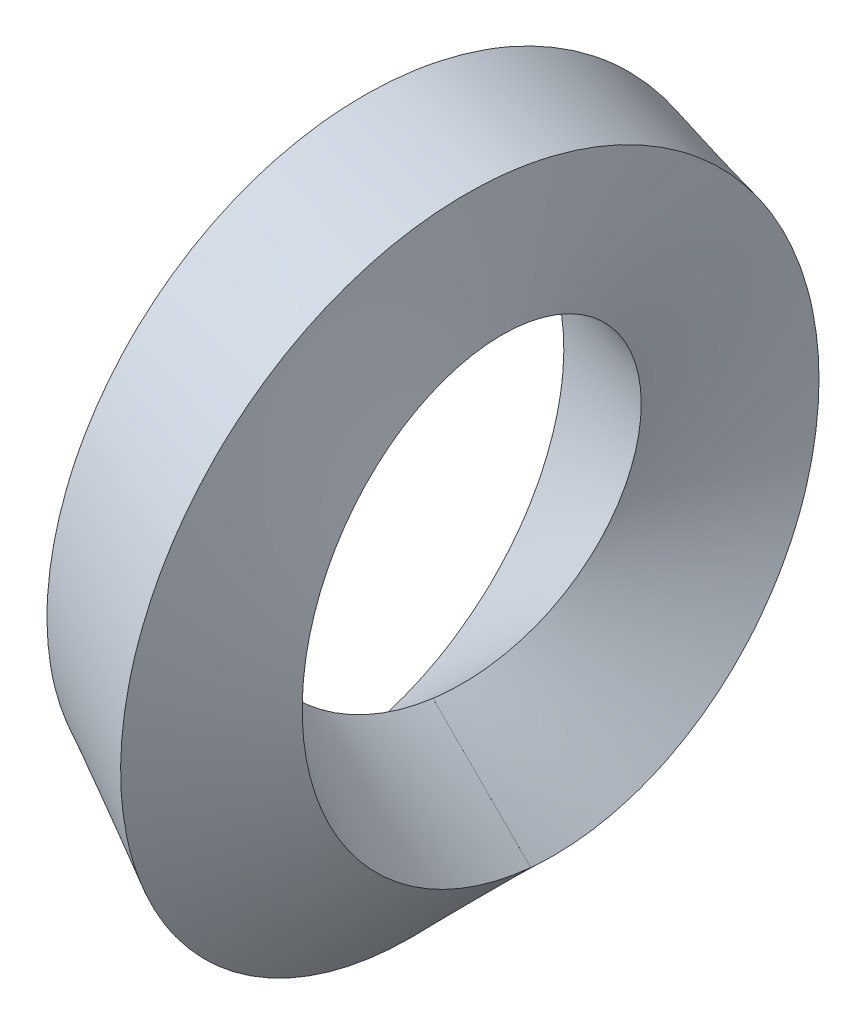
ISO-10303-21;
HEADER;
FILE_DESCRIPTION(('STEP AP214'),'2;1');
FILE_NAME('part.step','',(''),(''),'','','');
FILE_SCHEMA(('AUTOMOTIVE_DESIGN { 1 0 10303 214 1 1 1 1 }'));
ENDSEC;
DATA;
#1=APPLICATION_CONTEXT('core data for automotive mechanical design processes');
#2=APPLICATION_PROTOCOL_DEFINITION('international standard','automotive_design',2000,#1);
#3=PRODUCT_CONTEXT('',#1,'mechanical');
#4=PRODUCT('Part','Part','',(#3));
#5=PRODUCT_RELATED_PRODUCT_CATEGORY('part','',(#4));
#6=PRODUCT_DEFINITION_FORMATION('','',#4);
#7=PRODUCT_DEFINITION_CONTEXT('part definition',#1,'design');
#8=PRODUCT_DEFINITION('design','',#6,#7);
#9=PRODUCT_DEFINITION_SHAPE('','',#8);
#10=(LENGTH_UNIT() NAMED_UNIT(*) SI_UNIT(.MILLI.,.METRE.));
#11=(NAMED_UNIT(*) PLANE_ANGLE_UNIT() SI_UNIT($,.RADIAN.));
#12=(NAMED_UNIT(*) SI_UNIT($,.STERADIAN.) SOLID_ANGLE_UNIT());
#13=UNCERTAINTY_MEASURE_WITH_UNIT(LENGTH_MEASURE(1.E-05),#10,'distance_accuracy_value','');
#14=(GEOMETRIC_REPRESENTATION_CONTEXT(3) GLOBAL_UNCERTAINTY_ASSIGNED_CONTEXT((#13)) GLOBAL_UNIT_ASSIGNED_CONTEXT((#10,
#11,#12)) REPRESENTATION_CONTEXT('',''));
#15=CARTESIAN_POINT('',(0.,0.,0.));
#16=DIRECTION('',(0.,0.,1.));
#17=DIRECTION('',(1.,0.,0.));
#18=AXIS2_PLACEMENT_3D('',#15,#16,#17);
#19=CARTESIAN_POINT('',(-0.000564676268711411,-77.4168021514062,0.00336312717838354));
#20=CARTESIAN_POINT('',(-6.02606842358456,-83.4423058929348,0.00366696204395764));
#21=CARTESIAN_POINT('',(-12.0515721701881,-89.4678096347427,0.00397938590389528));
#22=CARTESIAN_POINT('',(-18.0770759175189,-95.4933133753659,0.00430039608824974));
#23=CARTESIAN_POINT('',(-0.16250546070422,-77.4167241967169,1.0666477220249));
#24=CARTESIAN_POINT('',(-6.13597719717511,-83.4961999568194,1.29579136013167));
#25=CARTESIAN_POINT('',(-12.1065149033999,-89.5771828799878,1.52160507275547));
#26=CARTESIAN_POINT('',(-18.0770601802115,-95.6580541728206,1.74629977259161));
#27=CARTESIAN_POINT('',(-0.656271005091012,-77.2471295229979,4.30888083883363));
#28=CARTESIAN_POINT('',(-6.46168044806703,-83.4530644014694,5.20668321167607));
#29=CARTESIAN_POINT('',(-12.265908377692,-89.659605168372,6.10314967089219));
#30=CARTESIAN_POINT('',(-18.0701395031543,-95.8660998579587,6.99916925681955));
#31=CARTESIAN_POINT('',(-1.64168047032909,-75.8921358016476,10.685110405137));
#32=CARTESIAN_POINT('',(-7.09933838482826,-82.1046209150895,13.0066477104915));
#33=CARTESIAN_POINT('',(-12.5573089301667,-88.3169426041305,15.3285487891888));
#34=CARTESIAN_POINT('',(-18.0152790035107,-94.5292738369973,17.6505749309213));
#35=CARTESIAN_POINT('',(-2.77632983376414,-72.4264595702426,17.4798744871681));
#36=CARTESIAN_POINT('',(-7.80873282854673,-78.129069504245,21.4864433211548));
#37=CARTESIAN_POINT('',(-12.8411338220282,-83.8316759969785,25.4930169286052));
#38=CARTESIAN_POINT('',(-17.8735352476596,-89.5342797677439,29.4995930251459));
#39=CARTESIAN_POINT('',(-3.89475143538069,-67.3502101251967,23.1397736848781));
#40=CARTESIAN_POINT('',(-8.48221528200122,-72.0414241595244,28.6545350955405));
#41=CARTESIAN_POINT('',(-13.0696788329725,-76.7326326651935,34.1693017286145));
#42=CARTESIAN_POINT('',(-17.6571428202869,-81.4238383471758,39.6840704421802));
#43=CARTESIAN_POINT('',(-4.84517665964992,-62.031628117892,27.0234123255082));
#44=CARTESIAN_POINT('',(-9.03671738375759,-65.5378492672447,33.6304817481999));
#45=CARTESIAN_POINT('',(-13.2282575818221,-69.0440643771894,40.2375545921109));
#46=CARTESIAN_POINT('',(-17.4197981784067,-72.5502764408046,46.8446287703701));
#47=CARTESIAN_POINT('',(-5.78151499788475,-55.9683133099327,29.7414535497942));
#48=CARTESIAN_POINT('',(-9.56499918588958,-58.0283439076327,37.1583488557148));
#49=CARTESIAN_POINT('',(-13.3484829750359,-60.0883682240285,44.5752460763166));
#50=CARTESIAN_POINT('',(-17.1319670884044,-62.1483892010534,51.9921440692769));
#51=CARTESIAN_POINT('',(-6.70101536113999,-49.4033899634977,31.1531082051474));
#52=CARTESIAN_POINT('',(-10.0654851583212,-49.8291954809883,39.0348161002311));
#53=CARTESIAN_POINT('',(-13.4299546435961,-50.2549949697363,46.9165244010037));
#54=CARTESIAN_POINT('',(-16.794424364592,-50.6807908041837,54.7982328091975));
#55=CARTESIAN_POINT('',(-7.60092774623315,-42.6070767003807,31.1656259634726));
#56=CARTESIAN_POINT('',(-10.5365999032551,-41.2985104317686,39.1244788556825));
#57=CARTESIAN_POINT('',(-13.4722718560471,-39.9899387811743,47.0833308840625));
#58=CARTESIAN_POINT('',(-16.4079439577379,-38.6813633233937,55.042182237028));
#59=CARTESIAN_POINT('',(-8.4785017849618,-35.8677629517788,29.7398487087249));
#60=CARTESIAN_POINT('',(-10.9767675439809,-32.821779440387,37.3687720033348));
#61=CARTESIAN_POINT('',(-13.4750331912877,-29.7757915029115,44.997693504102));
#62=CARTESIAN_POINT('',(-15.9732989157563,-26.7297999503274,52.6266135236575));
#63=CARTESIAN_POINT('',(-9.33098689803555,-29.4818301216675,26.8942236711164));
#64=CARTESIAN_POINT('',(-11.3844133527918,-24.7954786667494,33.7918271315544));
#65=CARTESIAN_POINT('',(-13.4378397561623,-20.1091239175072,40.6894282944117));
#66=CARTESIAN_POINT('',(-15.4912661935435,-15.4227662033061,47.587027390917));
#67=CARTESIAN_POINT('',(-10.1560122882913,-23.7431306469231,22.7063314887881));
#68=CARTESIAN_POINT('',(-11.7585261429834,-17.6096586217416,28.5024741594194));
#69=CARTESIAN_POINT('',(-13.3610399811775,-11.4761844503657,34.2986144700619));
#70=CARTESIAN_POINT('',(-14.9635538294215,-5.34270822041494,40.0947525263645));
#71=CARTESIAN_POINT('',(-11.0872476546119,-18.1076657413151,16.3917929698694));
#72=CARTESIAN_POINT('',(-12.1561837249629,-10.6064457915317,20.5285488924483));
#73=CARTESIAN_POINT('',(-13.2251197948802,-3.10522488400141,24.6653028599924));
#74=CARTESIAN_POINT('',(-14.2940558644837,4.39599699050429,28.8020548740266));
#75=CARTESIAN_POINT('',(-11.9675595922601,-14.2314646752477,8.61887678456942));
#76=CARTESIAN_POINT('',(-12.5000531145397,-5.88331924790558,10.7486384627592));
#77=CARTESIAN_POINT('',(-13.0325466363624,2.46482634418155,12.8783990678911));
#78=CARTESIAN_POINT('',(-13.5650401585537,10.8129721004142,15.0081586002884));
#79=CARTESIAN_POINT('',(-12.7931190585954,-12.5072091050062,-0.0148226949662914));
#80=CARTESIAN_POINT('',(-12.7892011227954,-3.91550522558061,-0.0312331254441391));
#81=CARTESIAN_POINT('',(-12.7852831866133,4.67619858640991,-0.0476435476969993));
#82=CARTESIAN_POINT('',(-12.7813652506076,13.2679023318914,-0.0640539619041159));
#83=CARTESIAN_POINT('',(-13.4658055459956,-12.6337937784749,-7.74213430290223));
#84=CARTESIAN_POINT('',(-13.0004304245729,-4.25963551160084,-9.60389036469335));
#85=CARTESIAN_POINT('',(-12.535055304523,4.11452289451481,-11.4656454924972));
#86=CARTESIAN_POINT('',(-12.069680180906,12.4886814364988,-13.3273997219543));
#87=CARTESIAN_POINT('',(-14.0991334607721,-14.4354727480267,-15.4236014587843));
#88=CARTESIAN_POINT('',(-13.1736793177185,-6.6925884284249,-19.0273792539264));
#89=CARTESIAN_POINT('',(-12.2482251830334,1.05029661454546,-22.63115534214));
#90=CARTESIAN_POINT('',(-11.3227710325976,8.79318233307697,-26.2349298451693));
#91=CARTESIAN_POINT('',(-14.6913010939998,-17.9034332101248,-22.6979934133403));
#92=CARTESIAN_POINT('',(-13.3084971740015,-11.1673420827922,-27.8449773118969));
#93=CARTESIAN_POINT('',(-11.9256932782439,-4.43124934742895,-32.9919590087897));
#94=CARTESIAN_POINT('',(-10.5428893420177,2.30484480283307,-38.1389387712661));
#95=CARTESIAN_POINT('',(-15.3342854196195,-23.812466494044,-30.3150232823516));
#96=CARTESIAN_POINT('',(-13.4208146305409,-18.6238763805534,-36.9391040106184));
#97=CARTESIAN_POINT('',(-11.5073438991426,-13.4352834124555,-43.5631823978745));
#98=CARTESIAN_POINT('',(-9.59387307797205,-8.24668813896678,-50.1872588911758));
#99=CARTESIAN_POINT('',(-15.909195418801,-31.7793235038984,-36.264754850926));
#100=CARTESIAN_POINT('',(-13.474974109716,-28.4794971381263,-43.8496376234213));
#101=CARTESIAN_POINT('',(-11.0407529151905,-25.1796666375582,-51.4345185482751));
#102=CARTESIAN_POINT('',(-8.60653155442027,-21.8798332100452,-59.0193981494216));
#103=CARTESIAN_POINT('',(-16.4877306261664,-42.5845661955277,-40.479815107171));
#104=CARTESIAN_POINT('',(-13.47065782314,-41.6013689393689,-48.4955476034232));
#105=CARTESIAN_POINT('',(-10.4535852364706,-40.6181664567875,-56.5112794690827));
#106=CARTESIAN_POINT('',(-7.43651235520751,-39.6349610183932,-64.5270108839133));
#107=CARTESIAN_POINT('',(-16.9868972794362,-54.5716266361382,-41.6995211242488));
#108=CARTESIAN_POINT('',(-13.3997213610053,-55.9028628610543,-49.461134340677));
#109=CARTESIAN_POINT('',(-9.81254577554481,-57.2340933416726,-57.2227486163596));
#110=CARTESIAN_POINT('',(-6.22536976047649,-58.5653213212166,-64.984363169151));
#111=CARTESIAN_POINT('',(-17.3845373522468,-66.641026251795,-38.9497173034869));
#112=CARTESIAN_POINT('',(-13.2515695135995,-69.9751714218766,-45.7206673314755));
#113=CARTESIAN_POINT('',(-9.11860208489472,-73.3093110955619,-52.4916202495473));
#114=CARTESIAN_POINT('',(-4.98563412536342,-76.6434486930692,-59.2625738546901));
#115=CARTESIAN_POINT('',(-17.6595759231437,-76.3652228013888,-33.6952126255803));
#116=CARTESIAN_POINT('',(-13.066473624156,-81.0719594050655,-39.1918910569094));
#117=CARTESIAN_POINT('',(-8.47337206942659,-85.7786916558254,-44.6885740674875));
#118=CARTESIAN_POINT('',(-3.88027008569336,-90.4854220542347,-50.1852582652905));
#119=CARTESIAN_POINT('',(-17.8447529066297,-83.7104096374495,-27.3432549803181));
#120=CARTESIAN_POINT('',(-12.8694079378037,-89.2815475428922,-31.541131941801));
#121=CARTESIAN_POINT('',(-7.89405373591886,-94.852668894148,-35.7390079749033));
#122=CARTESIAN_POINT('',(-2.91869539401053,-100.423783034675,-39.9368872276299));
#123=CARTESIAN_POINT('',(-17.9741220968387,-89.4668070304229,-19.6093067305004));
#124=CARTESIAN_POINT('',(-12.6414156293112,-95.5405251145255,-22.433494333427));
#125=CARTESIAN_POINT('',(-7.30876820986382,-101.614317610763,-25.2577277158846));
#126=CARTESIAN_POINT('',(-1.97614249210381,-107.688139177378,-28.0819573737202));
#127=CARTESIAN_POINT('',(-18.0358448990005,-92.6246132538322,-12.7363823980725));
#128=CARTESIAN_POINT('',(-12.4393687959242,-98.8305860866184,-14.4890764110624));
#129=CARTESIAN_POINT('',(-6.84330773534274,-105.037102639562,-16.2420550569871));
#130=CARTESIAN_POINT('',(-1.24740262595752,-111.243837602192,-17.9949881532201));
#131=CARTESIAN_POINT('',(-18.0604295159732,-94.0985208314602,-7.88341281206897));
#132=CARTESIAN_POINT('',(-12.2937508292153,-100.288533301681,-8.93064719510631));
#133=CARTESIAN_POINT('',(-6.52680324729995,-106.478190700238,-9.97770942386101));
#134=CARTESIAN_POINT('',(-0.759754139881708,-112.667704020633,-11.0248107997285));
#135=CARTESIAN_POINT('',(-18.0697869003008,-94.7514620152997,-5.09773633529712));
#136=CARTESIAN_POINT('',(-12.2090560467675,-100.903866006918,-5.77121951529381));
#137=CARTESIAN_POINT('',(-6.34902363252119,-107.057187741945,-6.4451777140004));
#138=CARTESIAN_POINT('',(-0.489254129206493,-113.210879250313,-7.11905781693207));
#139=CARTESIAN_POINT('',(-18.0748415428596,-95.1993142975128,-2.60355165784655));
#140=CARTESIAN_POINT('',(-12.132259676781,-101.303914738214,-2.90711407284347));
#141=CARTESIAN_POINT('',(-6.18704344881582,-107.405049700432,-3.20892318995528));
#142=CARTESIAN_POINT('',(-0.240834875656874,-113.504785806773,-3.51106154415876));
#143=CARTESIAN_POINT('',(-18.0759524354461,-95.4190313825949,-0.780752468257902));
#144=CARTESIAN_POINT('',(-12.0752158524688,-101.463289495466,-0.94313952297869));
#145=CARTESIAN_POINT('',(-6.08018310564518,-107.515049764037,-1.10934915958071));
#146=CARTESIAN_POINT('',(-0.0872987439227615,-113.56983746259,-1.27487122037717));
#147=CARTESIAN_POINT('',(-18.0759465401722,-95.4933133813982,0.00416428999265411));
#148=CARTESIAN_POINT('',(-12.0504427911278,-101.518817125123,0.00437739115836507));
#149=CARTESIAN_POINT('',(-6.02493904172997,-107.544320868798,0.00458190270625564));
#150=CARTESIAN_POINT('',(0.000564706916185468,-113.569824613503,0.00477782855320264));
#151=B_SPLINE_SURFACE_WITH_KNOTS('',3,3,((#19,#20,#21,#22),(#23,#24,#25,#26),(#27,#28,#29,#30),
(#31,#32,#33,#34),(#35,#36,#37,#38),(#39,#40,#41,#42),(#43,#44,#45,#46),(#47,#48,#49,#50),(#51,
#52,#53,#54),(#55,#56,#57,#58),(#59,#60,#61,#62),(#63,#64,#65,#66),(#67,#68,#69,#70),(#71,#72,
#73,#74),(#75,#76,#77,#78),(#79,#80,#81,#82),(#83,#84,#85,#86),(#87,#88,#89,#90),(#91,#92,#93,
#94),(#95,#96,#97,#98),(#99,#100,#101,#102),(#103,#104,#105,#106),(#107,#108,#109,#110),(#111,
#112,#113,#114),(#115,#116,#117,#118),(#119,#120,#121,#122),(#123,#124,#125,#126),(#127,#128,
#129,#130),(#131,#132,#133,#134),(#135,#136,#137,#138),(#139,#140,#141,#142),(#143,#144,#145,
#146),(#147,#148,#149,#150)),.UNSPECIFIED.,.F.,.F.,.F.,(4,1,1,1,1,1,1,1,1,1,1,1,1,1,1,1,1,1,1,1,
1,1,1,1,1,1,1,1,1,1,4),(4,4),(0.,0.0140653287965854,0.0424527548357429,0.085665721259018,
0.114949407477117,0.144633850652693,0.174735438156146,0.205269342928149,0.23624953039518,
0.267688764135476,0.29959858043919,0.331989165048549,0.364869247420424,0.415122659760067,
0.449255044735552,0.483895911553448,0.519047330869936,0.554709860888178,0.590882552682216,
0.646092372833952,0.68352648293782,0.740603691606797,0.79876802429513,0.838131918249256,
0.877952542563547,0.91821686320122,0.95549022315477,0.969127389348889,0.979395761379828,
0.98968947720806,1.),(0.,1.),.UNSPECIFIED.);
#152=CARTESIAN_POINT('',(0.000564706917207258,-113.569824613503,0.00477782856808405));
#153=CARTESIAN_POINT('',(-0.752623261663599,-112.816636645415,0.00475333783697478));
#154=CARTESIAN_POINT('',(-1.50581123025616,-112.063448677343,0.00472871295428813));
#155=CARTESIAN_POINT('',(-3.01218716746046,-110.557072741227,0.00467919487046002));
#156=CARTESIAN_POINT('',(-3.7653751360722,-109.803884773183,0.00465430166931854));
#157=CARTESIAN_POINT('',(-5.27175107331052,-108.297508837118,0.00460424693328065));
#158=CARTESIAN_POINT('',(-6.02493904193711,-107.544320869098,0.00457908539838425));
#159=CARTESIAN_POINT('',(-7.53131497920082,-106.037944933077,0.00452849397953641));
#160=CARTESIAN_POINT('',(-8.28450294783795,-105.284756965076,0.00450306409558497));
#161=CARTESIAN_POINT('',(-9.79087888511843,-103.77838102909,0.00445193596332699));
#162=CARTESIAN_POINT('',(-10.5440668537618,-103.025193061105,0.00442623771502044));
#163=CARTESIAN_POINT('',(-12.0504427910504,-101.518817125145,0.00437457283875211));
#164=CARTESIAN_POINT('',(-12.8036307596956,-100.765629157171,0.00434860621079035));
#165=CARTESIAN_POINT('',(-14.3100066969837,-99.259253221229,0.0042964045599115));
#166=CARTESIAN_POINT('',(-15.0631946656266,-98.5060652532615,0.00427016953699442));
#167=CARTESIAN_POINT('',(-16.5695706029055,-96.9996893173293,0.00421743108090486));
#168=CARTESIAN_POINT('',(-17.3227585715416,-96.2465013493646,0.00419092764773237));
#169=CARTESIAN_POINT('',(-18.0759465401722,-95.493313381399,0.00416429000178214));
#170=B_SPLINE_CURVE_WITH_KNOTS('',3,(#152,#153,#154,#155,#156,#157,#158,#159,#160,#161,#162,
#163,#164,#165,#166,#167,#168,#169),.UNSPECIFIED.,.F.,.F.,(4,2,2,2,2,2,2,2,4),(0.,
3.19550592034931,6.39101184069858,9.58651776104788,12.7820236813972,15.9775296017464,
19.1730355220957,22.368541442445,25.5640473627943),.UNSPECIFIED.);
#171=CARTESIAN_POINT('',(0.000564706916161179,-113.569824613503,0.00477782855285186));
#172=VERTEX_POINT('',#171);
#173=CARTESIAN_POINT('',(-18.0759465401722,-95.4933133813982,0.00416428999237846));
#174=VERTEX_POINT('',#173);
#175=EDGE_CURVE('E13',#172,#174,#170,.T.);
#176=CARTESIAN_POINT('',(-0.000564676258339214,-77.4168021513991,0.00336312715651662));
#177=CARTESIAN_POINT('',(-0.052966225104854,-77.4167759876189,0.347426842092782));
#178=CARTESIAN_POINT('',(-0.116210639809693,-77.4099375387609,0.762683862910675));
#179=CARTESIAN_POINT('',(-0.244550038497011,-77.3790776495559,1.6048884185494));
#180=CARTESIAN_POINT('',(-0.377237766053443,-77.3219914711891,2.47455304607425));
#181=CARTESIAN_POINT('',(-0.539785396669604,-77.2216563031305,3.53778047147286));
#182=CARTESIAN_POINT('',(-1.13974676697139,-76.6958648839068,7.44687377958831));
#183=CARTESIAN_POINT('',(-2.01140000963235,-74.9402856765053,12.9906095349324));
#184=CARTESIAN_POINT('',(-3.13538584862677,-70.8855576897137,19.3582170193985));
#185=CARTESIAN_POINT('',(-4.08712181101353,-66.3485475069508,23.9996491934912));
#186=CARTESIAN_POINT('',(-5.02709923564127,-60.9125303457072,27.6356767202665));
#187=CARTESIAN_POINT('',(-5.95257070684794,-54.7877502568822,30.0962727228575));
#188=CARTESIAN_POINT('',(-6.86074362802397,-48.2164460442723,31.2526928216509));
#189=CARTESIAN_POINT('',(-7.74908713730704,-41.4655104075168,31.022787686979));
#190=CARTESIAN_POINT('',(-8.6151603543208,-34.8183834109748,29.376696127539));
#191=CARTESIAN_POINT('',(-9.45651344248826,-28.5651649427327,26.3410218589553));
#192=CARTESIAN_POINT('',(-10.2706959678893,-22.9915373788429,22.0008750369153));
#193=CARTESIAN_POINT('',(-11.1203973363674,-17.9831935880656,16.043131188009));
#194=CARTESIAN_POINT('',(-11.9935971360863,-14.1510513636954,8.36227757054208));
#195=CARTESIAN_POINT('',(-12.8160476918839,-12.4149815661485,-0.259318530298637));
#196=CARTESIAN_POINT('',(-13.5343667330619,-12.7498378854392,-8.57690584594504));
#197=CARTESIAN_POINT('',(-14.1586355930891,-14.7102768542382,-16.1721932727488));
#198=CARTESIAN_POINT('',(-14.7423463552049,-18.3058078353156,-23.3311267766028));
#199=CARTESIAN_POINT('',(-15.2837508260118,-23.4440423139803,-29.7017728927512));
#200=CARTESIAN_POINT('',(-15.8229108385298,-30.5035178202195,-35.3916533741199));
#201=CARTESIAN_POINT('',(-16.3810234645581,-40.2559903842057,-39.9578295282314));
#202=CARTESIAN_POINT('',(-16.8556365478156,-51.2595255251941,-41.5428146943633));
#203=CARTESIAN_POINT('',(-17.2274638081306,-61.7496738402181,-40.211291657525));
#204=CARTESIAN_POINT('',(-17.4974298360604,-70.4947584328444,-37.1015808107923));
#205=CARTESIAN_POINT('',(-17.7173599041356,-78.5442262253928,-32.0847466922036));
#206=CARTESIAN_POINT('',(-17.9153183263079,-86.6568562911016,-24.1660666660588));
#207=CARTESIAN_POINT('',(-18.0269991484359,-92.0416869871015,-14.9175949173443));
#208=CARTESIAN_POINT('',(-18.0640957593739,-94.3075240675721,-7.2659351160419));
#209=CARTESIAN_POINT('',(-18.0721479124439,-94.9585218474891,-3.9519494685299));
#210=CARTESIAN_POINT('',(-18.0744422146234,-95.1890707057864,-2.53570932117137));
#211=CARTESIAN_POINT('',(-18.0756791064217,-95.3572538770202,-1.31099950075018));
#212=CARTESIAN_POINT('',(-18.0759487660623,-95.4604308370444,-0.343295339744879));
#213=CARTESIAN_POINT('',(-18.0759465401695,-95.493313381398,0.0041642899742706));
#214=B_SPLINE_CURVE_WITH_KNOTS('',3,(#176,#177,#178,#179,#180,#181,#182,#183,#184,#185,#186,
#187,#188,#189,#190,#191,#192,#193,#194,#195,#196,#197,#198,#199,#200,#201,#202,#203,#204,#205,
#206,#207,#208,#209,#210,#211,#212,#213),.UNSPECIFIED.,.F.,.F.,(4,1,1,1,1,1,1,1,1,1,1,1,1,1,1,1,
1,1,1,1,1,1,1,1,1,1,1,1,1,1,1,1,1,1,1,4),(0.,0.00454980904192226,0.00909497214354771,
0.0136331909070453,0.0196701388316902,0.0271991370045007,0.0808955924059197,0.116197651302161,
0.151135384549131,0.185737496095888,0.220033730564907,0.254054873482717,0.287832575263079,
0.32139902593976,0.3547868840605,0.38802928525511,0.421159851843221,0.462467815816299,
0.503721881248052,0.536731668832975,0.569784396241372,0.602914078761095,0.636154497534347,
0.669539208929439,0.711523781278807,0.762362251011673,0.796581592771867,0.831098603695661,
0.865943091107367,0.901143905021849,0.9546740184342,0.98027487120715,0.986328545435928,
0.990879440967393,0.99543736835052,1.),.UNSPECIFIED.);
#215=CARTESIAN_POINT('',(-0.000564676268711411,-77.4168021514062,0.00336312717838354));
#216=VERTEX_POINT('',#215);
#217=EDGE_CURVE('E451',#216,#174,#214,.T.);
#218=CARTESIAN_POINT('',(-0.000564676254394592,-77.4168021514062,0.00336312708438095));
#219=CARTESIAN_POINT('',(-0.753752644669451,-78.1699901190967,0.00340110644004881));
#220=CARTESIAN_POINT('',(-1.50694061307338,-78.9231780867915,0.00343921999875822));
#221=CARTESIAN_POINT('',(-3.01331654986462,-80.4295540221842,0.00351571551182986));
#222=CARTESIAN_POINT('',(-3.76650451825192,-81.182741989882,0.00355409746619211));
#223=CARTESIAN_POINT('',(-5.27288045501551,-82.689117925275,0.0036311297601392));
#224=CARTESIAN_POINT('',(-6.02606842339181,-83.4423058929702,0.00366978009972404));
#225=CARTESIAN_POINT('',(-7.53244436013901,-84.948681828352,0.00374734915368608));
#226=CARTESIAN_POINT('',(-8.28563232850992,-85.7018697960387,0.00378626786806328));
#227=CARTESIAN_POINT('',(-9.79200826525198,-87.208245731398,0.00386437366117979));
#228=CARTESIAN_POINT('',(-10.5451962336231,-87.9614336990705,0.0039035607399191));
#229=CARTESIAN_POINT('',(-12.0515721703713,-89.4678096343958,0.00398220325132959));
#230=CARTESIAN_POINT('',(-12.8047601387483,-90.2209976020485,0.00402165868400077));
#231=CARTESIAN_POINT('',(-14.3111360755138,-91.7273735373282,0.00410083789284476));
#232=CARTESIAN_POINT('',(-15.0643240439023,-92.4805615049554,0.00414056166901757));
#233=CARTESIAN_POINT('',(-16.5706999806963,-93.9869374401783,0.00422027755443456));
#234=CARTESIAN_POINT('',(-17.3238879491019,-94.7401254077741,0.00426026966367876));
#235=CARTESIAN_POINT('',(-18.0770759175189,-95.4933133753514,0.00430039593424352));
#236=B_SPLINE_CURVE_WITH_KNOTS('',3,(#218,#219,#220,#221,#222,#223,#224,#225,#226,#227,#228,
#229,#230,#231,#232,#233,#234,#235),.UNSPECIFIED.,.F.,.F.,(4,2,2,2,2,2,2,2,4),(0.,
3.19550592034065,6.39101184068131,9.58651776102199,12.7820236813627,15.9775296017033,
19.173035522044,22.3685414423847,25.5640473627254),.UNSPECIFIED.);
#237=CARTESIAN_POINT('',(-18.0770759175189,-95.4933133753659,0.00430039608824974));
#238=VERTEX_POINT('',#237);
#239=EDGE_CURVE('E347',#238,#216,#236,.F.);
#240=CARTESIAN_POINT('',(-18.0770759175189,-95.4933133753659,0.00430039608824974));
#241=CARTESIAN_POINT('',(-18.0770601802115,-95.6580541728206,1.74629977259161));
#242=CARTESIAN_POINT('',(-18.0701395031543,-95.8660998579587,6.99916925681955));
#243=CARTESIAN_POINT('',(-18.0152790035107,-94.5292738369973,17.6505749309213));
#244=CARTESIAN_POINT('',(-17.8735352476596,-89.5342797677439,29.4995930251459));
#245=CARTESIAN_POINT('',(-17.6571428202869,-81.4238383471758,39.6840704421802));
#246=CARTESIAN_POINT('',(-17.4197981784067,-72.5502764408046,46.8446287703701));
#247=CARTESIAN_POINT('',(-17.1319670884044,-62.1483892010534,51.9921440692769));
#248=CARTESIAN_POINT('',(-16.794424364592,-50.6807908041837,54.7982328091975));
#249=CARTESIAN_POINT('',(-16.4079439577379,-38.6813633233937,55.042182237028));
#250=CARTESIAN_POINT('',(-15.9732989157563,-26.7297999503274,52.6266135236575));
#251=CARTESIAN_POINT('',(-15.4912661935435,-15.4227662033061,47.587027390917));
#252=CARTESIAN_POINT('',(-14.9635538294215,-5.34270822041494,40.0947525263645));
#253=CARTESIAN_POINT('',(-14.2940558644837,4.39599699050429,28.8020548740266));
#254=CARTESIAN_POINT('',(-13.5650401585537,10.8129721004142,15.0081586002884));
#255=CARTESIAN_POINT('',(-12.7813652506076,13.2679023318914,-0.0640539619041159));
#256=CARTESIAN_POINT('',(-12.069680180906,12.4886814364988,-13.3273997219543));
#257=CARTESIAN_POINT('',(-11.3227710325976,8.79318233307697,-26.2349298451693));
#258=CARTESIAN_POINT('',(-10.5428893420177,2.30484480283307,-38.1389387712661));
#259=CARTESIAN_POINT('',(-9.59387307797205,-8.24668813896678,-50.1872588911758));
#260=CARTESIAN_POINT('',(-8.60653155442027,-21.8798332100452,-59.0193981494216));
#261=CARTESIAN_POINT('',(-7.43651235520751,-39.6349610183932,-64.5270108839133));
#262=CARTESIAN_POINT('',(-6.22536976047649,-58.5653213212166,-64.984363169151));
#263=CARTESIAN_POINT('',(-4.98563412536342,-76.6434486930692,-59.2625738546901));
#264=CARTESIAN_POINT('',(-3.88027008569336,-90.4854220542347,-50.1852582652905));
#265=CARTESIAN_POINT('',(-2.91869539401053,-100.423783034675,-39.9368872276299));
#266=CARTESIAN_POINT('',(-1.97614249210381,-107.688139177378,-28.0819573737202));
#267=CARTESIAN_POINT('',(-1.24740262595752,-111.243837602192,-17.9949881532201));
#268=CARTESIAN_POINT('',(-0.759754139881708,-112.667704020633,-11.0248107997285));
#269=CARTESIAN_POINT('',(-0.489254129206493,-113.210879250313,-7.11905781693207));
#270=CARTESIAN_POINT('',(-0.240834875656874,-113.504785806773,-3.51106154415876));
#271=CARTESIAN_POINT('',(-0.0872987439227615,-113.56983746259,-1.27487122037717));
#272=CARTESIAN_POINT('',(0.000564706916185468,-113.569824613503,0.00477782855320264));
#273=B_SPLINE_CURVE_WITH_KNOTS('',3,(#240,#241,#242,#243,#244,#245,#246,#247,#248,#249,#250,
#251,#252,#253,#254,#255,#256,#257,#258,#259,#260,#261,#262,#263,#264,#265,#266,#267,#268,#269,
#270,#271,#272),.UNSPECIFIED.,.F.,.F.,(4,1,1,1,1,1,1,1,1,1,1,1,1,1,1,1,1,1,1,1,1,1,1,1,1,1,1,1,
1,1,4),(0.,0.0140653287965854,0.0424527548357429,0.085665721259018,0.114949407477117,
0.144633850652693,0.174735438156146,0.205269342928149,0.23624953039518,0.267688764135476,
0.29959858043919,0.331989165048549,0.364869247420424,0.415122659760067,0.449255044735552,
0.483895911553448,0.519047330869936,0.554709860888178,0.590882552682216,0.646092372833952,
0.68352648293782,0.740603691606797,0.79876802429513,0.838131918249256,0.877952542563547,
0.91821686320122,0.95549022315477,0.969127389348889,0.979395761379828,0.98968947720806,1.),.UNSPECIFIED.);
#274=EDGE_CURVE('E291',#238,#172,#273,.T.);
#275=ORIENTED_EDGE('',*,*,#175,.T.);
#276=ORIENTED_EDGE('',*,*,#217,.F.);
#277=ORIENTED_EDGE('',*,*,#239,.F.);
#278=ORIENTED_EDGE('',*,*,#274,.T.);
#279=EDGE_LOOP('',(#275,#276,#277,#278));
#280=FACE_BOUND('',#279,.T.);
#281=ADVANCED_FACE('F277',(#280),#151,.F.);
#282=CARTESIAN_POINT('',(-18.187295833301,-95.6046626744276,0.00416990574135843));
#283=CARTESIAN_POINT('',(-12.1246756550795,-89.5420425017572,0.00386409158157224));
#284=CARTESIAN_POINT('',(-6.06205547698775,-83.4794223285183,0.00356697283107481));
#285=CARTESIAN_POINT('',(0.000564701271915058,-77.4168021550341,0.00327854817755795));
#286=CARTESIAN_POINT('',(-18.1875000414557,-95.5716524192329,-0.34331290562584));
#287=CARTESIAN_POINT('',(-12.1138997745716,-89.5159764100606,-0.34234170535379));
#288=CARTESIAN_POINT('',(-6.03751133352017,-83.4618024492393,-0.343798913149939));
#289=CARTESIAN_POINT('',(0.0531144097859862,-77.4168064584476,-0.34175680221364));
#290=CARTESIAN_POINT('',(-18.1877949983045,-95.4677722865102,-1.31441681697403));
#291=CARTESIAN_POINT('',(-12.0834279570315,-89.4503954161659,-1.12836157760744));
#292=CARTESIAN_POINT('',(-5.9803507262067,-83.4323239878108,-0.941169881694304));
#293=CARTESIAN_POINT('',(0.116140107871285,-77.4100069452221,-0.755584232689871));
#294=CARTESIAN_POINT('',(-18.1872702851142,-95.2987865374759,-2.5414841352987));
#295=CARTESIAN_POINT('',(-12.0441374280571,-89.3251020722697,-2.22706182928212));
#296=CARTESIAN_POINT('',(-5.90066186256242,-83.35160274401,-1.91292979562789));
#297=CARTESIAN_POINT('',(0.244563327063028,-77.3792317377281,-1.59835999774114));
#298=CARTESIAN_POINT('',(-18.1857997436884,-95.0671558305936,-3.96109071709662));
#299=CARTESIAN_POINT('',(-11.9978127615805,-89.1523762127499,-3.46337913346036));
#300=CARTESIAN_POINT('',(-5.80995811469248,-83.2375261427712,-2.96554229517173));
#301=CARTESIAN_POINT('',(0.377220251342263,-77.3222408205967,-2.46786240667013));
#302=CARTESIAN_POINT('',(-18.1796752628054,-94.4133911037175,-7.28242892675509));
#303=CARTESIAN_POINT('',(-11.886735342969,-88.6492615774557,-6.38439097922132));
#304=CARTESIAN_POINT('',(-5.59347843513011,-82.885304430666,-5.48661994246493));
#305=CARTESIAN_POINT('',(0.701396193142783,-77.1223914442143,-4.58844335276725));
#306=CARTESIAN_POINT('',(-18.1470472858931,-92.139253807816,-14.9508567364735));
#307=CARTESIAN_POINT('',(-11.6108023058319,-86.827046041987,-13.1398549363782));
#308=CARTESIAN_POINT('',(-5.0745540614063,-81.5148436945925,-11.3288450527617));
#309=CARTESIAN_POINT('',(1.46170922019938,-76.2026538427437,-9.51782254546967));
#310=CARTESIAN_POINT('',(-18.0410319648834,-86.7382274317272,-24.217257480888));
#311=CARTESIAN_POINT('',(-11.1963181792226,-82.30782370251,-21.430078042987));
#312=CARTESIAN_POINT('',(-4.35160412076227,-77.8774265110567,-18.6428887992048));
#313=CARTESIAN_POINT('',(2.49310940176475,-73.4470337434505,-15.8556914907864));
#314=CARTESIAN_POINT('',(-17.8487463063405,-78.6045907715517,-32.1481762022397));
#315=CARTESIAN_POINT('',(-10.6951683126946,-75.3179302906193,-28.6946381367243));
#316=CARTESIAN_POINT('',(-3.54159002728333,-72.0312782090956,-25.2410926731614));
#317=CARTESIAN_POINT('',(3.61198800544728,-68.744632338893,-21.7875407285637));
#318=CARTESIAN_POINT('',(-17.6332890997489,-70.5364011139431,-37.1702674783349));
#319=CARTESIAN_POINT('',(-10.2361778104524,-68.2690875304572,-33.4304936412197));
#320=CARTESIAN_POINT('',(-2.8390662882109,-66.0017829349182,-29.6907148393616));
#321=CARTESIAN_POINT('',(4.55804503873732,-63.7344854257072,-25.9509313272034));
#322=CARTESIAN_POINT('',(-17.3674073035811,-61.7732297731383,-40.280235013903));
#323=CARTESIAN_POINT('',(-9.74792238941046,-60.4906829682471,-36.5264852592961));
#324=CARTESIAN_POINT('',(-2.12843731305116,-59.208144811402,-32.7727329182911));
#325=CARTESIAN_POINT('',(5.49104763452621,-57.9256140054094,-29.0189777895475));
#326=CARTESIAN_POINT('',(-16.9998687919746,-51.2642284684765,-41.6068901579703));
#327=CARTESIAN_POINT('',(-9.14687494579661,-51.0081678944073,-38.1181819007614));
#328=CARTESIAN_POINT('',(-1.29388102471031,-50.7521147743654,-34.6294733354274));
#329=CARTESIAN_POINT('',(6.55911284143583,-50.4960685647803,-31.1407641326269));
#330=CARTESIAN_POINT('',(-16.5292137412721,-40.2450526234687,-40.0111079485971));
#331=CARTESIAN_POINT('',(-8.46071742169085,-40.8405793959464,-37.1102648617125));
#332=CARTESIAN_POINT('',(-0.392221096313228,-41.4361117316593,-34.2094230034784));
#333=CARTESIAN_POINT('',(7.67627522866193,-42.0316496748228,-31.3085823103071));
#334=CARTESIAN_POINT('',(-15.9743208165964,-30.4836827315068,-35.4308603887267));
#335=CARTESIAN_POINT('',(-7.73052184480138,-31.5636411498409,-33.2961612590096));
#336=CARTESIAN_POINT('',(0.513277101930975,-32.6436033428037,-31.1614639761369));
#337=CARTESIAN_POINT('',(8.75707606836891,-33.7235694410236,-29.0267687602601));
#338=CARTESIAN_POINT('',(-15.4374112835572,-23.4215245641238,-29.728442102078));
#339=CARTESIAN_POINT('',(-7.07108075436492,-24.6475454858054,-28.2763871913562));
#340=CARTESIAN_POINT('',(1.29524974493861,-25.8735688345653,-26.824334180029));
#341=CARTESIAN_POINT('',(9.6615802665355,-27.0995946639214,-25.3722834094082));
#342=CARTESIAN_POINT('',(-14.8976406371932,-18.284666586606,-23.3471675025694));
#343=CARTESIAN_POINT('',(-6.44235348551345,-19.4357413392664,-22.4738002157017));
#344=CARTESIAN_POINT('',(2.01293363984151,-20.5868175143,-21.6004345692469));
#345=CARTESIAN_POINT('',(10.4682207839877,-21.73789501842,-20.7270708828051));
#346=CARTESIAN_POINT('',(-14.3151186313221,-14.6937777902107,-16.1796273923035));
#347=CARTESIAN_POINT('',(-5.79510742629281,-15.5921001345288,-15.7748628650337));
#348=CARTESIAN_POINT('',(2.7249037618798,-16.4904231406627,-15.3700994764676));
#349=CARTESIAN_POINT('',(11.2449149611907,-17.3887466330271,-14.9653374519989));
#350=CARTESIAN_POINT('',(-13.6915905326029,-12.740381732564,-8.57861238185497));
#351=CARTESIAN_POINT('',(-5.13124719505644,-13.2552396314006,-8.48569684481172));
#352=CARTESIAN_POINT('',(3.42909613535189,-13.7700977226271,-8.39278178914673));
#353=CARTESIAN_POINT('',(11.9894394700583,-14.2849558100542,-8.29986730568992));
#354=CARTESIAN_POINT('',(-12.9735854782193,-12.4145970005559,-0.258548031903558));
#355=CARTESIAN_POINT('',(-4.39614654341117,-12.4355353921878,-0.300499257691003));
#356=CARTESIAN_POINT('',(4.18129239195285,-12.4564738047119,-0.342450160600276));
#357=CARTESIAN_POINT('',(12.7587313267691,-12.4774120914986,-0.38440071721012));
#358=CARTESIAN_POINT('',(-12.1508774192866,-14.1606354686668,8.36089496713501));
#359=CARTESIAN_POINT('',(-3.58745872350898,-13.6388109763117,8.43617338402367));
#360=CARTESIAN_POINT('',(4.97595997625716,-13.1169867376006,8.51145298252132));
#361=CARTESIAN_POINT('',(13.5393786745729,-12.5951627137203,8.58673382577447));
#362=CARTESIAN_POINT('',(-11.2767515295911,-18.0007928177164,16.0345526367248));
#363=CARTESIAN_POINT('',(-2.76375553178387,-17.0425698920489,16.5016278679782));
#364=CARTESIAN_POINT('',(5.74924046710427,-16.0843478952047,16.9687049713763));
#365=CARTESIAN_POINT('',(14.2622364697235,-15.1261268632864,17.4357839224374));
#366=CARTESIAN_POINT('',(-10.42563807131,-23.0133569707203,21.9823319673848));
#367=CARTESIAN_POINT('',(-1.98952593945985,-21.8253485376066,22.9919439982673));
#368=CARTESIAN_POINT('',(6.44658618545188,-20.6373419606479,24.0015582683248));
#369=CARTESIAN_POINT('',(14.8826983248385,-19.4493372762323,25.0111746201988));
#370=CARTESIAN_POINT('',(-9.6097051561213,-28.5874421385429,26.3115082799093));
#371=CARTESIAN_POINT('',(-1.26889626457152,-27.3745185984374,27.9184301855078));
#372=CARTESIAN_POINT('',(7.07191261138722,-26.1615979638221,29.5253543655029));
#373=CARTESIAN_POINT('',(15.4127215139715,-24.948680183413,31.1322805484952));
#374=CARTESIAN_POINT('',(-8.76616160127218,-34.8371723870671,29.3355704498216));
#375=CARTESIAN_POINT('',(-0.544616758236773,-33.8141714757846,31.57473475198));
#376=CARTESIAN_POINT('',(7.67692806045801,-32.7911746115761,33.8139009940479));
#377=CARTESIAN_POINT('',(15.8984729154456,-31.7681816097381,36.0530688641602));
#378=CARTESIAN_POINT('',(-7.89746432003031,-41.4767031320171,30.9706537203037));
#379=CARTESIAN_POINT('',(0.181208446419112,-40.8672943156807,33.809184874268));
#380=CARTESIAN_POINT('',(8.25988118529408,-40.2578906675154,36.6477172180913));
#381=CARTESIAN_POINT('',(16.3385539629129,-39.6484919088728,39.4862505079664));
#382=CARTESIAN_POINT('',(-7.00606962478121,-48.216138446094,31.1914178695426));
#383=CARTESIAN_POINT('',(0.906475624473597,-48.2328861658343,34.5276470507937));
#384=CARTESIAN_POINT('',(8.81902085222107,-48.2496400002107,37.8638762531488));
#385=CARTESIAN_POINT('',(16.7315661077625,-48.2663997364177,41.200105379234));
#386=CARTESIAN_POINT('',(-6.09442465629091,-54.7726032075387,30.028902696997));
#387=CARTESIAN_POINT('',(1.62907849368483,-55.5973125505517,33.6969895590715));
#388=CARTESIAN_POINT('',(9.35258165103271,-56.4220286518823,37.3650748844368));
#389=CARTESIAN_POINT('',(17.0760847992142,-57.2467515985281,41.0331587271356));
#390=CARTESIAN_POINT('',(-5.165068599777,-60.880097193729,27.5662518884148));
#391=CARTESIAN_POINT('',(2.34693104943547,-62.6459806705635,31.3462165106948));
#392=CARTESIAN_POINT('',(9.85893076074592,-64.4118710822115,35.1261777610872));
#393=CARTESIAN_POINT('',(17.3709303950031,-66.1777691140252,38.906135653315));
#394=CARTESIAN_POINT('',(-4.22080865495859,-66.2975398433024,23.9329323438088));
#395=CARTESIAN_POINT('',(3.05802118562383,-69.0747472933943,27.5654558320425));
#396=CARTESIAN_POINT('',(10.3368511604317,-71.8519612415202,31.1979740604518));
#397=CARTESIAN_POINT('',(17.615680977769,-74.6291830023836,34.8304866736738));
#398=CARTESIAN_POINT('',(-3.26440583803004,-70.8160305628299,19.2993588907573));
#399=CARTESIAN_POINT('',(3.76032839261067,-74.6015647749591,22.5039996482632));
#400=CARTESIAN_POINT('',(10.7850628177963,-78.3871044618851,25.7086334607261));
#401=CARTESIAN_POINT('',(17.8097970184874,-82.1726512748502,28.9132593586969));
#402=CARTESIAN_POINT('',(-2.13452703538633,-74.8508325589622,12.9469855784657));
#403=CARTESIAN_POINT('',(4.56935394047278,-79.7212744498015,15.322173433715));
#404=CARTESIAN_POINT('',(11.273209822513,-84.5917363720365,17.6973465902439));
#405=CARTESIAN_POINT('',(17.977060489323,-89.4622061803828,20.0725139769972));
#406=CARTESIAN_POINT('',(-1.2579165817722,-76.5943958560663,7.42026111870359));
#407=CARTESIAN_POINT('',(5.1760507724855,-82.1190722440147,8.86923498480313));
#408=CARTESIAN_POINT('',(11.6114679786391,-87.642815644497,10.3185608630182));
#409=CARTESIAN_POINT('',(18.0471680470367,-93.1664093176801,11.7676299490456));
#410=CARTESIAN_POINT('',(-0.654414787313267,-77.1144171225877,3.52494214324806));
#411=CARTESIAN_POINT('',(5.58679934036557,-82.9532526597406,4.22394967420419));
#412=CARTESIAN_POINT('',(11.8275364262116,-88.7923968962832,4.92282959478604));
#413=CARTESIAN_POINT('',(18.0681802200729,-94.6315926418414,5.62178084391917));
#414=CARTESIAN_POINT('',(-0.49087502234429,-77.2133488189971,2.4654030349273));
#415=CARTESIAN_POINT('',(5.69631342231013,-83.1286035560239,2.96359149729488));
#416=CARTESIAN_POINT('',(11.8841824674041,-89.0434200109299,3.46194055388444));
#417=CARTESIAN_POINT('',(18.0721843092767,-94.9581657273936,3.96016448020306));
#418=CARTESIAN_POINT('',(-0.357416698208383,-77.269386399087,1.59910133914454));
#419=CARTESIAN_POINT('',(5.78783009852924,-83.2417244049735,1.91419241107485));
#420=CARTESIAN_POINT('',(11.9313161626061,-89.2151985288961,2.22883638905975));
#421=CARTESIAN_POINT('',(18.0744583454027,-95.1888585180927,2.54377031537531));
#422=CARTESIAN_POINT('',(-0.228181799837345,-77.2993285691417,0.759266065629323));
#423=CARTESIAN_POINT('',(5.86825657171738,-83.3216665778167,0.94534440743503));
#424=CARTESIAN_POINT('',(11.9713229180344,-89.3397297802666,1.13306393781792));
#425=CARTESIAN_POINT('',(18.0756834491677,-95.3570957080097,1.31964823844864));
#426=CARTESIAN_POINT('',(-0.16483043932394,-77.3057507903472,0.347379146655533));
#427=CARTESIAN_POINT('',(5.92591314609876,-83.3506684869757,0.349997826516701));
#428=CARTESIAN_POINT('',(12.002329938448,-89.4048270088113,0.349041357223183));
#429=CARTESIAN_POINT('',(18.0759491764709,-95.4604934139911,0.350510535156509));
#430=CARTESIAN_POINT('',(-0.111913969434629,-77.3054528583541,0.00335887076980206));
#431=CARTESIAN_POINT('',(5.95070621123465,-83.3680730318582,0.00359067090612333));
#432=CARTESIAN_POINT('',(12.0133263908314,-89.4306932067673,0.00381377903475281));
#433=CARTESIAN_POINT('',(18.0759465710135,-95.4933133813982,0.004028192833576));
#434=B_SPLINE_SURFACE_WITH_KNOTS('',3,3,((#282,#283,#284,#285),(#286,#287,#288,#289),(#290,#291,
#292,#293),(#294,#295,#296,#297),(#298,#299,#300,#301),(#302,#303,#304,#305),(#306,#307,#308,
#309),(#310,#311,#312,#313),(#314,#315,#316,#317),(#318,#319,#320,#321),(#322,#323,#324,#325),
(#326,#327,#328,#329),(#330,#331,#332,#333),(#334,#335,#336,#337),(#338,#339,#340,#341),(#342,
#343,#344,#345),(#346,#347,#348,#349),(#350,#351,#352,#353),(#354,#355,#356,#357),(#358,#359,
#360,#361),(#362,#363,#364,#365),(#366,#367,#368,#369),(#370,#371,#372,#373),(#374,#375,#376,
#377),(#378,#379,#380,#381),(#382,#383,#384,#385),(#386,#387,#388,#389),(#390,#391,#392,#393),
(#394,#395,#396,#397),(#398,#399,#400,#401),(#402,#403,#404,#405),(#406,#407,#408,#409),(#410,
#411,#412,#413),(#414,#415,#416,#417),(#418,#419,#420,#421),(#422,#423,#424,#425),(#426,#427,
#428,#429),(#430,#431,#432,#433)),.UNSPECIFIED.,.F.,.F.,.F.,(4,1,1,1,1,1,1,1,1,1,1,1,1,1,1,1,1,
1,1,1,1,1,1,1,1,1,1,1,1,1,1,1,1,1,1,4),(4,4),(0.,0.0045626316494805,0.00912055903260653,
0.0136714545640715,0.0197251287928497,0.0453259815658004,0.0988560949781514,0.134056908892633,
0.168901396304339,0.203418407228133,0.237637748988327,0.288476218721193,0.330460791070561,
0.363845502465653,0.397085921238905,0.430215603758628,0.463268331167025,0.496278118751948,
0.537532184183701,0.578840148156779,0.61197071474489,0.6452131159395,0.67860097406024,
0.712167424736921,0.745945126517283,0.779966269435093,0.814262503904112,0.848864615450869,
0.883802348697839,0.91910440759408,0.972800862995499,0.98032986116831,0.986366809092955,
0.990905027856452,0.995450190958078,1.),(0.,1.),.UNSPECIFIED.);
#435=CARTESIAN_POINT('',(-18.0759465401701,-95.4933133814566,0.00416429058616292));
#436=CARTESIAN_POINT('',(-17.3227585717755,-94.7401254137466,0.00412631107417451));
#437=CARTESIAN_POINT('',(-16.569570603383,-93.9869374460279,0.00408846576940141));
#438=CARTESIAN_POINT('',(-15.0631946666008,-92.4805615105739,0.0040130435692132));
#439=CARTESIAN_POINT('',(-14.3100066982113,-91.7273735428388,0.00397546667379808));
#440=CARTESIAN_POINT('',(-12.8036307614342,-90.2209976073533,0.00390058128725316));
#441=CARTESIAN_POINT('',(-12.0504427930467,-89.4678096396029,0.00386327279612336));
#442=CARTESIAN_POINT('',(-10.5440668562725,-87.9614337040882,0.00378892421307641));
#443=CARTESIAN_POINT('',(-9.79087888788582,-87.2082457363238,0.00375188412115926));
#444=CARTESIAN_POINT('',(-8.28450295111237,-85.7018698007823,0.00367807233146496));
#445=CARTESIAN_POINT('',(-7.53131498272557,-84.9486818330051,0.00364130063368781));
#446=CARTESIAN_POINT('',(-6.02493904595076,-83.4423058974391,0.00356802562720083));
#447=CARTESIAN_POINT('',(-5.27175107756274,-82.6891179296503,0.00353152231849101));
#448=CARTESIAN_POINT('',(-3.76537514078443,-81.1827419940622,0.00345878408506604));
#449=CARTESIAN_POINT('',(-3.01218717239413,-80.429554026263,0.00342254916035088));
#450=CARTESIAN_POINT('',(-1.50581123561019,-78.9231780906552,0.00335034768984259));
#451=CARTESIAN_POINT('',(-0.752623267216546,-78.1699901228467,0.00331438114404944));
#452=CARTESIAN_POINT('',(0.00056470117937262,-77.4168021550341,0.00327854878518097));
#453=B_SPLINE_CURVE_WITH_KNOTS('',3,(#435,#436,#437,#438,#439,#440,#441,#442,#443,#444,#445,
#446,#447,#448,#449,#450,#451,#452),.UNSPECIFIED.,.F.,.F.,(4,2,2,2,2,2,2,2,4),(0.,
3.19550592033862,6.39101184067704,9.5865177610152,12.782023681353,15.9775296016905,
19.1730355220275,22.3685414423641,25.5640473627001),.UNSPECIFIED.);
#454=CARTESIAN_POINT('',(0.000564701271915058,-77.4168021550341,0.00327854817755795));
#455=VERTEX_POINT('',#454);
#456=EDGE_CURVE('E299',#174,#455,#453,.T.);
#457=CARTESIAN_POINT('',(18.0759465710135,-95.4933133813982,0.00402819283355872));
#458=CARTESIAN_POINT('',(18.0748476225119,-95.3341849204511,1.68458148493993));
#459=CARTESIAN_POINT('',(18.0726247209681,-94.8881996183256,4.68248731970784));
#460=CARTESIAN_POINT('',(18.0577635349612,-93.9150013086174,8.59011196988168));
#461=CARTESIAN_POINT('',(18.0398688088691,-92.8712522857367,11.7498089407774));
#462=CARTESIAN_POINT('',(18.0146777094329,-91.5150878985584,15.1137039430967));
#463=CARTESIAN_POINT('',(17.9789878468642,-89.7393208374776,18.6218263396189));
#464=CARTESIAN_POINT('',(17.9303986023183,-87.4767328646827,22.1919883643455));
#465=CARTESIAN_POINT('',(17.877531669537,-85.136507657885,25.268320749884));
#466=CARTESIAN_POINT('',(17.8166444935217,-82.5639611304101,28.1098952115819));
#467=CARTESIAN_POINT('',(17.7477660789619,-79.7819595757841,30.699848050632));
#468=CARTESIAN_POINT('',(17.6709293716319,-76.8145132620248,33.0235021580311));
#469=CARTESIAN_POINT('',(17.5861661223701,-73.6865699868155,35.0684348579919));
#470=CARTESIAN_POINT('',(17.4935084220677,-70.4238057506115,36.824526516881));
#471=CARTESIAN_POINT('',(17.392988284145,-67.0524144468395,38.283989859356));
#472=CARTESIAN_POINT('',(17.2846376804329,-63.5988984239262,39.4413802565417));
#473=CARTESIAN_POINT('',(17.1494189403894,-59.5137324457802,40.4335064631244));
#474=CARTESIAN_POINT('',(16.9923213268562,-55.0870403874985,41.0218490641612));
#475=CARTESIAN_POINT('',(16.8213892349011,-50.6633489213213,41.088814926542));
#476=CARTESIAN_POINT('',(16.6640933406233,-46.88460032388,40.7839176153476));
#477=CARTESIAN_POINT('',(16.5115234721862,-43.4664664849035,40.2133570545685));
#478=CARTESIAN_POINT('',(16.351510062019,-40.1379968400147,39.3626492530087));
#479=CARTESIAN_POINT('',(16.1841390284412,-36.9215568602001,38.242916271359));
#480=CARTESIAN_POINT('',(16.009496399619,-33.8382614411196,36.8670060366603));
#481=CARTESIAN_POINT('',(15.8276681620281,-30.9078480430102,35.2493589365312));
#482=CARTESIAN_POINT('',(15.6387402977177,-28.1485636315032,33.4058657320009));
#483=CARTESIAN_POINT('',(15.4427987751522,-25.5770659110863,31.35371826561));
#484=CARTESIAN_POINT('',(15.2399295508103,-23.2083392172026,29.1112543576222));
#485=CARTESIAN_POINT('',(15.0302185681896,-21.0556252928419,26.6977983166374));
#486=CARTESIAN_POINT('',(14.8137517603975,-19.1303690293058,24.1334984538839));
#487=CARTESIAN_POINT('',(14.5906150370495,-17.4421791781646,21.4391630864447));
#488=CARTESIAN_POINT('',(14.3608943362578,-15.9988036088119,18.6360959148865));
#489=CARTESIAN_POINT('',(14.1052481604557,-14.7080305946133,15.5082395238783));
#490=CARTESIAN_POINT('',(13.8215433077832,-13.6512971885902,12.0542700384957));
#491=CARTESIAN_POINT('',(13.5280608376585,-12.9679193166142,8.5378103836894));
#492=CARTESIAN_POINT('',(13.2480348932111,-12.6472676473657,5.25905141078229));
#493=CARTESIAN_POINT('',(12.940349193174,-12.5992933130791,1.75016476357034));
#494=CARTESIAN_POINT('',(12.6235416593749,-12.9153820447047,-1.7206171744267));
#495=CARTESIAN_POINT('',(12.3208104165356,-13.5391856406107,-4.86970494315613));
#496=CARTESIAN_POINT('',(12.060937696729,-14.2532934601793,-7.46265714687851));
#497=CARTESIAN_POINT('',(11.7969641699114,-15.1481841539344,-9.9785049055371));
#498=CARTESIAN_POINT('',(11.503442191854,-16.3419019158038,-12.614804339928));
#499=CARTESIAN_POINT('',(11.2047723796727,-17.74065350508,-15.1240282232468));
#500=CARTESIAN_POINT('',(10.901092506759,-19.3317559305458,-17.4910332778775));
#501=CARTESIAN_POINT('',(10.5925403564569,-21.1014920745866,-19.701890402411));
#502=CARTESIAN_POINT('',(10.2792537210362,-23.0352238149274,-21.7439456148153));
#503=CARTESIAN_POINT('',(9.96137039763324,-25.1175069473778,-23.6058711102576));
#504=CARTESIAN_POINT('',(9.63902812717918,-27.3322078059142,-25.2777060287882));
#505=CARTESIAN_POINT('',(9.31236461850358,-29.6626209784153,-26.7508873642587));
#506=CARTESIAN_POINT('',(8.95420701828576,-32.2920916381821,-28.1228893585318));
#507=CARTESIAN_POINT('',(8.59085864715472,-35.0221952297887,-29.238454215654));
#508=CARTESIAN_POINT('',(8.25063352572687,-37.612169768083,-30.0251618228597));
#509=CARTESIAN_POINT('',(7.93619582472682,-40.0159365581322,-30.56931637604));
#510=CARTESIAN_POINT('',(7.56185937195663,-42.8775409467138,-31.0032470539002));
#511=CARTESIAN_POINT('',(7.15290810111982,-45.9797734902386,-31.1509382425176));
#512=CARTESIAN_POINT('',(6.73879692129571,-49.0617279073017,-30.9797739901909));
#513=CARTESIAN_POINT('',(6.38123039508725,-51.666867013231,-30.6185633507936));
#514=CARTESIAN_POINT('',(5.99095491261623,-54.4334739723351,-29.9998535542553));
#515=CARTESIAN_POINT('',(5.59718142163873,-57.1209102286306,-29.1317778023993));
#516=CARTESIAN_POINT('',(5.23056463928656,-59.5073366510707,-28.1090979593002));
#517=CARTESIAN_POINT('',(4.89295251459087,-61.6122653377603,-27.0220326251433));
#518=CARTESIAN_POINT('',(4.49233876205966,-63.9921033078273,-25.5679527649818));
#519=CARTESIAN_POINT('',(4.05741168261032,-66.3771191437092,-23.751515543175));
#520=CARTESIAN_POINT('',(3.55738096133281,-68.8644927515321,-21.4186063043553));
#521=CARTESIAN_POINT('',(3.0236719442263,-71.2330719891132,-18.691261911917));
#522=CARTESIAN_POINT('',(2.45460867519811,-73.3322284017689,-15.5024329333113));
#523=CARTESIAN_POINT('',(1.97818517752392,-74.7384036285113,-12.6609252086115));
#524=CARTESIAN_POINT('',(1.62822440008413,-75.5932227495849,-10.5058699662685));
#525=CARTESIAN_POINT('',(1.27796217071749,-76.3130481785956,-8.3056818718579));
#526=CARTESIAN_POINT('',(0.895163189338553,-76.9003486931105,-5.84947283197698));
#527=CARTESIAN_POINT('',(0.448004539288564,-77.322345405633,-2.9365698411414));
#528=CARTESIAN_POINT('',(0.160358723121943,-77.4189361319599,-1.04653361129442));
#529=CARTESIAN_POINT('',(0.000564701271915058,-77.4168021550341,0.00327854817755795));
#530=B_SPLINE_CURVE_WITH_KNOTS('',3,(#457,#458,#459,#460,#461,#462,#463,#464,#465,#466,#467,
#468,#469,#470,#471,#472,#473,#474,#475,#476,#477,#478,#479,#480,#481,#482,#483,#484,#485,#486,
#487,#488,#489,#490,#491,#492,#493,#494,#495,#496,#497,#498,#499,#500,#501,#502,#503,#504,#505,
#506,#507,#508,#509,#510,#511,#512,#513,#514,#515,#516,#517,#518,#519,#520,#521,#522,#523,#524,
#525,#526,#527,#528,#529),.UNSPECIFIED.,.F.,.F.,(4,1,1,1,1,1,1,1,1,1,1,1,1,1,1,1,1,1,1,1,1,1,1,
1,1,1,1,1,1,1,1,1,1,1,1,1,1,1,1,1,1,1,1,1,1,1,1,1,1,1,1,1,1,1,1,1,1,1,1,1,1,1,1,1,1,1,1,1,1,1,
4),(0.,0.0220664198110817,0.0395629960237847,0.0525928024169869,0.0655432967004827,
0.0869514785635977,0.103919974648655,0.120748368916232,0.137437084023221,0.153986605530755,
0.170397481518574,0.18667032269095,0.202805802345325,0.218804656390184,0.234667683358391,
0.250395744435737,0.273736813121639,0.292959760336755,0.308190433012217,0.323291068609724,
0.338262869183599,0.353107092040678,0.367825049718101,0.382418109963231,0.396887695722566,
0.411235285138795,0.425462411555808,0.439570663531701,0.453561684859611,0.467437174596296,
0.481198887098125,0.494848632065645,0.511756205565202,0.528495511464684,0.541768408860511,
0.554938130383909,0.574503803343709,0.587424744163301,0.597052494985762,0.60980732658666,
0.622470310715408,0.635043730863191,0.647529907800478,0.659931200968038,0.672250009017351,
0.684488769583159,0.696649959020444,0.70873609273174,0.720749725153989,0.73566876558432,
0.747528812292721,0.756381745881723,0.768131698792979,0.785646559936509,0.797253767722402,
0.808808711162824,0.820314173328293,0.834630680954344,0.846035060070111,0.854561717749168,
0.865897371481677,0.882835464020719,0.894088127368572,0.910915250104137,0.930479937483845,
0.944418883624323,0.952770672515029,0.961115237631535,0.975010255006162,0.98611880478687,1.),.UNSPECIFIED.);
#531=CARTESIAN_POINT('',(18.0759465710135,-95.4933133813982,0.00402819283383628));
#532=VERTEX_POINT('',#531);
#533=EDGE_CURVE('E436',#532,#455,#530,.T.);
#534=CARTESIAN_POINT('',(18.0759465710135,-95.4933133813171,0.00402819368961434));
#535=CARTESIAN_POINT('',(12.0133263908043,-89.4306932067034,0.00381377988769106));
#536=CARTESIAN_POINT('',(5.9507062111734,-83.3680730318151,0.0035906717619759));
#537=CARTESIAN_POINT('',(-0.111913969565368,-77.3054528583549,0.00335887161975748));
#538=B_SPLINE_CURVE_WITH_KNOTS('',3,(#534,#535,#536,#537),.UNSPECIFIED.,.F.,.F.,(4,4),(0.,1.),.UNSPECIFIED.);
#539=EDGE_CURVE('E331',#216,#532,#538,.F.);
#540=CARTESIAN_POINT('',(-18.187295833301,-95.6046626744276,0.00416990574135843));
#541=CARTESIAN_POINT('',(-12.1246756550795,-89.5420425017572,0.00386409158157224));
#542=CARTESIAN_POINT('',(-6.06205547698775,-83.4794223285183,0.00356697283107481));
#543=CARTESIAN_POINT('',(0.000564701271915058,-77.4168021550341,0.00327854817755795));
#544=CARTESIAN_POINT('',(0.000637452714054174,-77.416729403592,0.00327854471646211));
#545=CARTESIAN_POINT('',(0.00071020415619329,-77.4166566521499,0.00327854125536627));
#546=CARTESIAN_POINT('',(0.000782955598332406,-77.4165839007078,0.00327853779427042));
#547=CARTESIAN_POINT('',(-18.1875000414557,-95.5716524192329,-0.34331290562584));
#548=CARTESIAN_POINT('',(-12.1138997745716,-89.5159764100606,-0.34234170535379));
#549=CARTESIAN_POINT('',(-6.03751133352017,-83.4618024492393,-0.343798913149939));
#550=CARTESIAN_POINT('',(0.0531144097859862,-77.4168064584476,-0.34175680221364));
#551=CARTESIAN_POINT('',(0.0531874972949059,-77.4167339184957,-0.341756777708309));
#552=CARTESIAN_POINT('',(0.0532605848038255,-77.4166613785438,-0.341756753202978));
#553=CARTESIAN_POINT('',(0.0533336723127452,-77.4165888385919,-0.341756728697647));
#554=CARTESIAN_POINT('',(-18.1877949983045,-95.4677722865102,-1.31441681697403));
#555=CARTESIAN_POINT('',(-12.0834279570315,-89.4503954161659,-1.12836157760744));
#556=CARTESIAN_POINT('',(-5.9803507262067,-83.4323239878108,-0.941169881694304));
#557=CARTESIAN_POINT('',(0.116140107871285,-77.4100069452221,-0.755584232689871));
#558=CARTESIAN_POINT('',(0.116213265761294,-77.4099346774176,-0.755582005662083));
#559=CARTESIAN_POINT('',(0.116286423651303,-77.4098624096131,-0.755579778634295));
#560=CARTESIAN_POINT('',(0.116359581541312,-77.4097901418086,-0.755577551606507));
#561=CARTESIAN_POINT('',(-18.1872702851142,-95.2987865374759,-2.5414841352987));
#562=CARTESIAN_POINT('',(-12.0441374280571,-89.3251020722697,-2.22706182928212));
#563=CARTESIAN_POINT('',(-5.90066186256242,-83.35160274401,-1.91292979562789));
#564=CARTESIAN_POINT('',(0.244563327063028,-77.3792317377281,-1.59835999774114));
#565=CARTESIAN_POINT('',(0.244637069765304,-77.379160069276,-1.59835622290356));
#566=CARTESIAN_POINT('',(0.244710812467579,-77.3790884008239,-1.59835244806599));
#567=CARTESIAN_POINT('',(0.244784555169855,-77.3790167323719,-1.59834867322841));
#568=CARTESIAN_POINT('',(-18.1857997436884,-95.0671558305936,-3.96109071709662));
#569=CARTESIAN_POINT('',(-11.9978127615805,-89.1523762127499,-3.46337913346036));
#570=CARTESIAN_POINT('',(-5.80995811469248,-83.2375261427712,-2.96554229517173));
#571=CARTESIAN_POINT('',(0.377220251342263,-77.3222408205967,-2.46786240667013));
#572=CARTESIAN_POINT('',(0.377294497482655,-77.3221698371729,-2.46785643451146));
#573=CARTESIAN_POINT('',(0.377368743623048,-77.322098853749,-2.4678504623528));
#574=CARTESIAN_POINT('',(0.37744298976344,-77.3220278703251,-2.46784449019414));
#575=CARTESIAN_POINT('',(-18.1796752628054,-94.4133911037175,-7.28242892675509));
#576=CARTESIAN_POINT('',(-11.886735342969,-88.6492615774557,-6.38439097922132));
#577=CARTESIAN_POINT('',(-5.59347843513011,-82.885304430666,-5.48661994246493));
#578=CARTESIAN_POINT('',(0.701396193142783,-77.1223914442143,-4.58844335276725));
#579=CARTESIAN_POINT('',(0.701471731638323,-77.1223222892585,-4.58843257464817));
#580=CARTESIAN_POINT('',(0.701547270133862,-77.1222531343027,-4.58842179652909));
#581=CARTESIAN_POINT('',(0.701622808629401,-77.1221839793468,-4.58841101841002));
#582=CARTESIAN_POINT('',(-18.1470472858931,-92.139253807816,-14.9508567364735));
#583=CARTESIAN_POINT('',(-11.6108023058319,-86.827046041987,-13.1398549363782));
#584=CARTESIAN_POINT('',(-5.0745540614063,-81.5148436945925,-11.3288450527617));
#585=CARTESIAN_POINT('',(1.46170922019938,-76.2026538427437,-9.51782254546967));
#586=CARTESIAN_POINT('',(1.46178765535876,-76.2025900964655,-9.51780081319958));
#587=CARTESIAN_POINT('',(1.46186609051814,-76.2025263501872,-9.5177790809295));
#588=CARTESIAN_POINT('',(1.46194452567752,-76.202462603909,-9.51775734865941));
#589=CARTESIAN_POINT('',(-18.0410319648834,-86.7382274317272,-24.217257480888));
#590=CARTESIAN_POINT('',(-11.1963181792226,-82.30782370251,-21.430078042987));
#591=CARTESIAN_POINT('',(-4.35160412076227,-77.8774265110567,-18.6428887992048));
#592=CARTESIAN_POINT('',(2.49310940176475,-73.4470337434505,-15.8556914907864));
#593=CARTESIAN_POINT('',(2.49319153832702,-73.4469805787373,-15.8556580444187));
#594=CARTESIAN_POINT('',(2.49327367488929,-73.4469274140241,-15.855624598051));
#595=CARTESIAN_POINT('',(2.49335581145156,-73.4468742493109,-15.8555911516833));
#596=CARTESIAN_POINT('',(-17.8487463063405,-78.6045907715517,-32.1481762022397));
#597=CARTESIAN_POINT('',(-10.6951683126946,-75.3179302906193,-28.6946381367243));
#598=CARTESIAN_POINT('',(-3.54159002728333,-72.0312782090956,-25.2410926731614));
#599=CARTESIAN_POINT('',(3.61198800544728,-68.744632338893,-21.7875407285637));
#600=CARTESIAN_POINT('',(3.61207384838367,-68.7445928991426,-21.7874992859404));
#601=CARTESIAN_POINT('',(3.61215969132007,-68.7445534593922,-21.7874578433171));
#602=CARTESIAN_POINT('',(3.61224553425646,-68.7445140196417,-21.7874164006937));
#603=CARTESIAN_POINT('',(-17.6332890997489,-70.5364011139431,-37.1702674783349));
#604=CARTESIAN_POINT('',(-10.2361778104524,-68.2690875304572,-33.4304936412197));
#605=CARTESIAN_POINT('',(-2.8390662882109,-66.0017829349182,-29.6907148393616));
#606=CARTESIAN_POINT('',(4.55804503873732,-63.7344854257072,-25.9509313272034));
#607=CARTESIAN_POINT('',(4.55813380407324,-63.7344582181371,-25.9508864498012));
#608=CARTESIAN_POINT('',(4.55822256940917,-63.734431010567,-25.9508415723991));
#609=CARTESIAN_POINT('',(4.55831133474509,-63.7344038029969,-25.9507966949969));
#610=CARTESIAN_POINT('',(-17.3674073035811,-61.7732297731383,-40.280235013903));
#611=CARTESIAN_POINT('',(-9.74792238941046,-60.4906829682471,-36.5264852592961));
#612=CARTESIAN_POINT('',(-2.12843731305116,-59.208144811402,-32.7727329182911));
#613=CARTESIAN_POINT('',(5.49104763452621,-57.9256140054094,-29.0189777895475));
#614=CARTESIAN_POINT('',(5.49113906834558,-57.9255986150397,-29.0189327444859));
#615=CARTESIAN_POINT('',(5.49123050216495,-57.92558322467,-29.0188876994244));
#616=CARTESIAN_POINT('',(5.49132193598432,-57.9255678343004,-29.0188426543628));
#617=CARTESIAN_POINT('',(-16.9998687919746,-51.2642284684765,-41.6068901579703));
#618=CARTESIAN_POINT('',(-9.14687494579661,-51.0081678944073,-38.1181819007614));
#619=CARTESIAN_POINT('',(-1.29388102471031,-50.7521147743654,-34.6294733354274));
#620=CARTESIAN_POINT('',(6.55911284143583,-50.4960685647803,-31.1407641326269));
#621=CARTESIAN_POINT('',(6.55920707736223,-50.4960654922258,-31.1407222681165));
#622=CARTESIAN_POINT('',(6.55930131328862,-50.4960624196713,-31.140680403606));
#623=CARTESIAN_POINT('',(6.55939554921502,-50.4960593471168,-31.1406385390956));
#624=CARTESIAN_POINT('',(-16.5292137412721,-40.2450526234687,-40.0111079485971));
#625=CARTESIAN_POINT('',(-8.46071742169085,-40.8405793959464,-37.1102648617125));
#626=CARTESIAN_POINT('',(-0.392221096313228,-41.4361117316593,-34.2094230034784));
#627=CARTESIAN_POINT('',(7.67627522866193,-42.0316496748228,-31.3085823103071));
#628=CARTESIAN_POINT('',(7.67637205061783,-42.0316568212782,-31.3085475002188));
#629=CARTESIAN_POINT('',(7.67646887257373,-42.0316639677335,-31.3085126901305));
#630=CARTESIAN_POINT('',(7.67656569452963,-42.0316711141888,-31.3084778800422));
#631=CARTESIAN_POINT('',(-15.9743208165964,-30.4836827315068,-35.4308603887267));
#632=CARTESIAN_POINT('',(-7.73052184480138,-31.5636411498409,-33.2961612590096));
#633=CARTESIAN_POINT('',(0.513277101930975,-32.6436033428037,-31.1614639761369));
#634=CARTESIAN_POINT('',(8.75707606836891,-33.7235694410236,-29.0267687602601));
#635=CARTESIAN_POINT('',(8.75717499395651,-33.7235824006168,-29.0267431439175));
#636=CARTESIAN_POINT('',(8.75727391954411,-33.72359536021,-29.0267175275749));
#637=CARTESIAN_POINT('',(8.7573728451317,-33.7236083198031,-29.0266919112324));
#638=CARTESIAN_POINT('',(-15.4374112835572,-23.4215245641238,-29.728442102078));
#639=CARTESIAN_POINT('',(-7.07108075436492,-24.6475454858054,-28.2763871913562));
#640=CARTESIAN_POINT('',(1.29524974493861,-25.8735688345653,-26.824334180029));
#641=CARTESIAN_POINT('',(9.6615802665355,-27.0995946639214,-25.3722834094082));
#642=CARTESIAN_POINT('',(9.66168066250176,-27.0996093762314,-25.372265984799));
#643=CARTESIAN_POINT('',(9.66178105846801,-27.0996240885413,-25.3722485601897));
#644=CARTESIAN_POINT('',(9.66188145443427,-27.0996388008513,-25.3722311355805));
#645=CARTESIAN_POINT('',(-14.8976406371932,-18.284666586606,-23.3471675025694));
#646=CARTESIAN_POINT('',(-6.44235348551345,-19.4357413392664,-22.4738002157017));
#647=CARTESIAN_POINT('',(2.01293363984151,-20.5868175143,-21.6004345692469));
#648=CARTESIAN_POINT('',(10.4682207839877,-21.73789501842,-20.7270708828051));
#649=CARTESIAN_POINT('',(10.4683222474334,-21.73790883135,-20.7270604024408));
#650=CARTESIAN_POINT('',(10.4684237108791,-21.7379226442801,-20.7270499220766));
#651=CARTESIAN_POINT('',(10.4685251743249,-21.7379364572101,-20.7270394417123));
#652=CARTESIAN_POINT('',(-14.3151186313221,-14.6937777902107,-16.1796273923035));
#653=CARTESIAN_POINT('',(-5.79510742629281,-15.5921001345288,-15.7748628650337));
#654=CARTESIAN_POINT('',(2.7249037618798,-16.4904231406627,-15.3700994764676));
#655=CARTESIAN_POINT('',(11.2449149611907,-17.3887466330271,-14.9653374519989));
#656=CARTESIAN_POINT('',(11.2450172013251,-17.388757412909,-14.9653325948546));
#657=CARTESIAN_POINT('',(11.2451194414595,-17.3887681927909,-14.9653277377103));
#658=CARTESIAN_POINT('',(11.2452216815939,-17.3887789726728,-14.965322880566));
#659=CARTESIAN_POINT('',(-13.6915905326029,-12.740381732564,-8.57861238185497));
#660=CARTESIAN_POINT('',(-5.13124719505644,-13.2552396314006,-8.48569684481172));
#661=CARTESIAN_POINT('',(3.42909613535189,-13.7700977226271,-8.39278178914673));
#662=CARTESIAN_POINT('',(11.9894394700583,-14.2849558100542,-8.29986730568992));
#663=CARTESIAN_POINT('',(11.9895421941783,-14.2849619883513,-8.29986619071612));
#664=CARTESIAN_POINT('',(11.9896449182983,-14.2849681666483,-8.29986507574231));
#665=CARTESIAN_POINT('',(11.9897476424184,-14.2849743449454,-8.29986396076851));
#666=CARTESIAN_POINT('',(-12.9735854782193,-12.4145970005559,-0.258548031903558));
#667=CARTESIAN_POINT('',(-4.39614654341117,-12.4355353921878,-0.300499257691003));
#668=CARTESIAN_POINT('',(4.18129239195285,-12.4564738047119,-0.342450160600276));
#669=CARTESIAN_POINT('',(12.7587313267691,-12.4774120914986,-0.38440071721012));
#670=CARTESIAN_POINT('',(12.7588342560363,-12.4774123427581,-0.3844012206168));
#671=CARTESIAN_POINT('',(12.7589371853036,-12.4774125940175,-0.384401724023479));
#672=CARTESIAN_POINT('',(12.7590401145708,-12.4774128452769,-0.384402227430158));
#673=CARTESIAN_POINT('',(-12.1508774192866,-14.1606354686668,8.36089496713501));
#674=CARTESIAN_POINT('',(-3.58745872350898,-13.6388109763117,8.43617338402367));
#675=CARTESIAN_POINT('',(4.97595997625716,-13.1169867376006,8.51145298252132));
#676=CARTESIAN_POINT('',(13.5393786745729,-12.5951627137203,8.58673382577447));
#677=CARTESIAN_POINT('',(13.5394814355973,-12.595156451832,8.58673472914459));
#678=CARTESIAN_POINT('',(13.5395841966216,-12.5951501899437,8.58673563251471));
#679=CARTESIAN_POINT('',(13.539686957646,-12.5951439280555,8.58673653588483));
#680=CARTESIAN_POINT('',(-11.2767515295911,-18.0007928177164,16.0345526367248));
#681=CARTESIAN_POINT('',(-2.76375553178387,-17.0425698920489,16.5016278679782));
#682=CARTESIAN_POINT('',(5.74924046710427,-16.0843478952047,16.9687049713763));
#683=CARTESIAN_POINT('',(14.2622364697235,-15.1261268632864,17.4357839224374));
#684=CARTESIAN_POINT('',(14.2623386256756,-15.126115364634,17.4357895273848));
#685=CARTESIAN_POINT('',(14.2624407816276,-15.1261038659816,17.4357951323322));
#686=CARTESIAN_POINT('',(14.2625429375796,-15.1260923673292,17.4358007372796));
#687=CARTESIAN_POINT('',(-10.42563807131,-23.0133569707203,21.9823319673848));
#688=CARTESIAN_POINT('',(-1.98952593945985,-21.8253485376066,22.9919439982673));
#689=CARTESIAN_POINT('',(6.44658618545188,-20.6373419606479,24.0015582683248));
#690=CARTESIAN_POINT('',(14.8826983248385,-19.4493372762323,25.0111746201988));
#691=CARTESIAN_POINT('',(14.8827995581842,-19.4493230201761,25.0111867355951));
#692=CARTESIAN_POINT('',(14.8829007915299,-19.4493087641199,25.0111988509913));
#693=CARTESIAN_POINT('',(14.8830020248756,-19.4492945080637,25.0112109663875));
#694=CARTESIAN_POINT('',(-9.6097051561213,-28.5874421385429,26.3115082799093));
#695=CARTESIAN_POINT('',(-1.26889626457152,-27.3745185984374,27.9184301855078));
#696=CARTESIAN_POINT('',(7.07191261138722,-26.1615979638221,29.5253543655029));
#697=CARTESIAN_POINT('',(15.4127215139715,-24.948680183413,31.1322805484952));
#698=CARTESIAN_POINT('',(15.4128216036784,-24.9486656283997,31.1322998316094));
#699=CARTESIAN_POINT('',(15.4129216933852,-24.9486510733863,31.1323191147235));
#700=CARTESIAN_POINT('',(15.413021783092,-24.9486365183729,31.1323383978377));
#701=CARTESIAN_POINT('',(-8.76616160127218,-34.8371723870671,29.3355704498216));
#702=CARTESIAN_POINT('',(-0.544616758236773,-33.8141714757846,31.57473475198));
#703=CARTESIAN_POINT('',(7.67692806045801,-32.7911746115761,33.8139009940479));
#704=CARTESIAN_POINT('',(15.8984729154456,-31.7681816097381,36.0530688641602));
#705=CARTESIAN_POINT('',(15.8985715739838,-31.7681693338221,36.0530957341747));
#706=CARTESIAN_POINT('',(15.8986702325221,-31.7681570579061,36.0531226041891));
#707=CARTESIAN_POINT('',(15.8987688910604,-31.7681447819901,36.0531494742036));
#708=CARTESIAN_POINT('',(-7.89746432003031,-41.4767031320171,30.9706537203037));
#709=CARTESIAN_POINT('',(0.181208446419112,-40.8672943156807,33.809184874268));
#710=CARTESIAN_POINT('',(8.25988118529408,-40.2578906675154,36.6477172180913));
#711=CARTESIAN_POINT('',(16.3385539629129,-39.6484919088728,39.4862505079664));
#712=CARTESIAN_POINT('',(16.3386509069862,-39.6484845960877,39.4862845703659));
#713=CARTESIAN_POINT('',(16.3387478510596,-39.6484772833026,39.4863186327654));
#714=CARTESIAN_POINT('',(16.3388447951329,-39.6484699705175,39.4863526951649));
#715=CARTESIAN_POINT('',(-7.00606962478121,-48.216138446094,31.1914178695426));
#716=CARTESIAN_POINT('',(0.906475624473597,-48.2328861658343,34.5276470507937));
#717=CARTESIAN_POINT('',(8.81902085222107,-48.2496400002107,37.8638762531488));
#718=CARTESIAN_POINT('',(16.7315661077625,-48.2663997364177,41.200105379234));
#719=CARTESIAN_POINT('',(16.7316610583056,-48.2663999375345,41.2001454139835));
#720=CARTESIAN_POINT('',(16.7317560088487,-48.2664001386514,41.200185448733));
#721=CARTESIAN_POINT('',(16.7318509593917,-48.2664003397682,41.2002254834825));
#722=CARTESIAN_POINT('',(-6.09442465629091,-54.7726032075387,30.028902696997));
#723=CARTESIAN_POINT('',(1.62907849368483,-55.5973125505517,33.6969895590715));
#724=CARTESIAN_POINT('',(9.35258165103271,-56.4220286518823,37.3650748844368));
#725=CARTESIAN_POINT('',(17.0760847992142,-57.2467515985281,41.0331587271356));
#726=CARTESIAN_POINT('',(17.0761774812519,-57.2467614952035,41.0332027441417));
#727=CARTESIAN_POINT('',(17.0762701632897,-57.2467713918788,41.0332467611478));
#728=CARTESIAN_POINT('',(17.0763628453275,-57.2467812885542,41.0332907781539));
#729=CARTESIAN_POINT('',(-5.165068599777,-60.880097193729,27.5662518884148));
#730=CARTESIAN_POINT('',(2.34693104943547,-62.6459806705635,31.3462165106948));
#731=CARTESIAN_POINT('',(9.85893076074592,-64.4118710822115,35.1261777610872));
#732=CARTESIAN_POINT('',(17.3709303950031,-66.1777691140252,38.906135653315));
#733=CARTESIAN_POINT('',(17.3710205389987,-66.1777903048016,38.9061810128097));
#734=CARTESIAN_POINT('',(17.3711106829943,-66.177811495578,38.9062263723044));
#735=CARTESIAN_POINT('',(17.3712008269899,-66.1778326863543,38.9062717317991));
#736=CARTESIAN_POINT('',(-4.22080865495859,-66.2975398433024,23.9329323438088));
#737=CARTESIAN_POINT('',(3.05802118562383,-69.0747472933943,27.5654558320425));
#738=CARTESIAN_POINT('',(10.3368511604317,-71.8519612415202,31.1979740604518));
#739=CARTESIAN_POINT('',(17.615680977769,-74.6291830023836,34.8304866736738));
#740=CARTESIAN_POINT('',(17.6157683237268,-74.6292163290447,34.8305302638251));
#741=CARTESIAN_POINT('',(17.6158556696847,-74.6292496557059,34.8305738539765));
#742=CARTESIAN_POINT('',(17.6159430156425,-74.629282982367,34.8306174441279));
#743=CARTESIAN_POINT('',(-3.26440583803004,-70.8160305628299,19.2993588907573));
#744=CARTESIAN_POINT('',(3.76032839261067,-74.6015647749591,22.5039996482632));
#745=CARTESIAN_POINT('',(10.7850628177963,-78.3871044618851,25.7086334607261));
#746=CARTESIAN_POINT('',(17.8097970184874,-82.1726512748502,28.9132593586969));
#747=CARTESIAN_POINT('',(17.8098813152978,-82.1726967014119,28.9132978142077));
#748=CARTESIAN_POINT('',(17.8099656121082,-82.1727421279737,28.9133362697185));
#749=CARTESIAN_POINT('',(17.8100499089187,-82.1727875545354,28.9133747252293));
#750=CARTESIAN_POINT('',(-2.13452703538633,-74.8508325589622,12.9469855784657));
#751=CARTESIAN_POINT('',(4.56935394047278,-79.7212744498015,15.322173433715));
#752=CARTESIAN_POINT('',(11.273209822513,-84.5917363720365,17.6973465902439));
#753=CARTESIAN_POINT('',(17.977060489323,-89.4622061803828,20.0725139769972));
#754=CARTESIAN_POINT('',(17.977140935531,-89.4622646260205,20.0725424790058));
#755=CARTESIAN_POINT('',(17.977221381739,-89.4623230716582,20.0725709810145));
#756=CARTESIAN_POINT('',(17.977301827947,-89.4623815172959,20.0725994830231));
#757=CARTESIAN_POINT('',(-1.2579165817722,-76.5943958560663,7.42026111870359));
#758=CARTESIAN_POINT('',(5.1760507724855,-82.1190722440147,8.86923498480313));
#759=CARTESIAN_POINT('',(11.6114679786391,-87.642815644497,10.3185608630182));
#760=CARTESIAN_POINT('',(18.0471680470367,-93.1664093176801,11.7676299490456));
#761=CARTESIAN_POINT('',(18.0472452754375,-93.1664756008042,11.7676473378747));
#762=CARTESIAN_POINT('',(18.0473225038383,-93.1665418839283,11.7676647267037));
#763=CARTESIAN_POINT('',(18.0473997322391,-93.1666081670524,11.7676821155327));
#764=CARTESIAN_POINT('',(-0.654414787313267,-77.1144171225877,3.52494214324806));
#765=CARTESIAN_POINT('',(5.58679934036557,-82.9532526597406,4.22394967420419));
#766=CARTESIAN_POINT('',(11.8275364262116,-88.7923968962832,4.92282959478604));
#767=CARTESIAN_POINT('',(18.0681802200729,-94.6315926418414,5.62178084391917));
#768=CARTESIAN_POINT('',(18.0682551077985,-94.6316627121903,5.62178923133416));
#769=CARTESIAN_POINT('',(18.068329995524,-94.6317327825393,5.62179761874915));
#770=CARTESIAN_POINT('',(18.0684048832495,-94.6318028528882,5.62180600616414));
#771=CARTESIAN_POINT('',(-0.49087502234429,-77.2133488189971,2.4654030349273));
#772=CARTESIAN_POINT('',(5.69631342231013,-83.1286035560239,2.96359149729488));
#773=CARTESIAN_POINT('',(11.8841824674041,-89.0434200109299,3.46194055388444));
#774=CARTESIAN_POINT('',(18.0721843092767,-94.9581657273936,3.96016448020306));
#775=CARTESIAN_POINT('',(18.0722585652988,-94.9582367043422,3.96017045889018));
#776=CARTESIAN_POINT('',(18.0723328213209,-94.9583076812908,3.96017643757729));
#777=CARTESIAN_POINT('',(18.072407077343,-94.9583786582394,3.96018241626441));
#778=CARTESIAN_POINT('',(-0.357416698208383,-77.269386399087,1.59910133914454));
#779=CARTESIAN_POINT('',(5.78783009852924,-83.2417244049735,1.91419241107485));
#780=CARTESIAN_POINT('',(11.9313161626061,-89.2151985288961,2.22883638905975));
#781=CARTESIAN_POINT('',(18.0744583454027,-95.1888585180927,2.54377031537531));
#782=CARTESIAN_POINT('',(18.0745320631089,-95.1889302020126,2.54377409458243));
#783=CARTESIAN_POINT('',(18.0746057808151,-95.1890018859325,2.54377787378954));
#784=CARTESIAN_POINT('',(18.0746794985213,-95.1890735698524,2.54378165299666));
#785=CARTESIAN_POINT('',(-0.228181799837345,-77.2993285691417,0.759266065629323));
#786=CARTESIAN_POINT('',(5.86825657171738,-83.3216665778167,0.94534440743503));
#787=CARTESIAN_POINT('',(11.9713229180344,-89.3397297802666,1.13306393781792));
#788=CARTESIAN_POINT('',(18.0756834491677,-95.3570957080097,1.31964823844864));
#789=CARTESIAN_POINT('',(18.0757567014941,-95.3571679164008,1.31965047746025));
#790=CARTESIAN_POINT('',(18.0758299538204,-95.3572401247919,1.31965271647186));
#791=CARTESIAN_POINT('',(18.0759032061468,-95.357312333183,1.31965495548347));
#792=CARTESIAN_POINT('',(-0.16483043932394,-77.3057507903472,0.347379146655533));
#793=CARTESIAN_POINT('',(5.92591314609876,-83.3506684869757,0.349997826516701));
#794=CARTESIAN_POINT('',(12.002329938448,-89.4048270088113,0.349041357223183));
#795=CARTESIAN_POINT('',(18.0759491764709,-95.4604934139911,0.350510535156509));
#796=CARTESIAN_POINT('',(18.0760220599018,-95.4605660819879,0.350510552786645));
#797=CARTESIAN_POINT('',(18.0760949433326,-95.4606387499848,0.35051057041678));
#798=CARTESIAN_POINT('',(18.0761678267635,-95.4607114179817,0.350510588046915));
#799=CARTESIAN_POINT('',(-0.111913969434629,-77.3054528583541,0.00335887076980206));
#800=CARTESIAN_POINT('',(5.95070621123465,-83.3680730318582,0.00359067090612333));
#801=CARTESIAN_POINT('',(12.0133263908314,-89.4306932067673,0.00381377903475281));
#802=CARTESIAN_POINT('',(18.0759465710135,-95.4933133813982,0.004028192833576));
#803=CARTESIAN_POINT('',(18.0760193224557,-95.4933861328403,0.00402819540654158));
#804=CARTESIAN_POINT('',(18.0760920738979,-95.4934588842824,0.00402819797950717));
#805=CARTESIAN_POINT('',(18.07616482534,-95.4935316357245,0.00402820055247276));
#806=B_SPLINE_SURFACE_WITH_KNOTS('',3,3,((#540,#541,#542,#543,#544,#545,#546),(#547,#548,#549,
#550,#551,#552,#553),(#554,#555,#556,#557,#558,#559,#560),(#561,#562,#563,#564,#565,#566,#567),
(#568,#569,#570,#571,#572,#573,#574),(#575,#576,#577,#578,#579,#580,#581),(#582,#583,#584,#585,
#586,#587,#588),(#589,#590,#591,#592,#593,#594,#595),(#596,#597,#598,#599,#600,#601,#602),(#603,
#604,#605,#606,#607,#608,#609),(#610,#611,#612,#613,#614,#615,#616),(#617,#618,#619,#620,#621,
#622,#623),(#624,#625,#626,#627,#628,#629,#630),(#631,#632,#633,#634,#635,#636,#637),(#638,#639,
#640,#641,#642,#643,#644),(#645,#646,#647,#648,#649,#650,#651),(#652,#653,#654,#655,#656,#657,
#658),(#659,#660,#661,#662,#663,#664,#665),(#666,#667,#668,#669,#670,#671,#672),(#673,#674,#675,
#676,#677,#678,#679),(#680,#681,#682,#683,#684,#685,#686),(#687,#688,#689,#690,#691,#692,#693),
(#694,#695,#696,#697,#698,#699,#700),(#701,#702,#703,#704,#705,#706,#707),(#708,#709,#710,#711,
#712,#713,#714),(#715,#716,#717,#718,#719,#720,#721),(#722,#723,#724,#725,#726,#727,#728),(#729,
#730,#731,#732,#733,#734,#735),(#736,#737,#738,#739,#740,#741,#742),(#743,#744,#745,#746,#747,
#748,#749),(#750,#751,#752,#753,#754,#755,#756),(#757,#758,#759,#760,#761,#762,#763),(#764,#765,
#766,#767,#768,#769,#770),(#771,#772,#773,#774,#775,#776,#777),(#778,#779,#780,#781,#782,#783,
#784),(#785,#786,#787,#788,#789,#790,#791),(#792,#793,#794,#795,#796,#797,#798),(#799,#800,#801,
#802,#803,#804,#805)),.UNSPECIFIED.,.F.,.F.,.F.,(4,1,1,1,1,1,1,1,1,1,1,1,1,1,1,1,1,1,1,1,1,1,1,
1,1,1,1,1,1,1,1,1,1,1,1,4),(4,3,4),(0.,0.0045626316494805,0.00912055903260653,
0.0136714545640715,0.0197251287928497,0.0453259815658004,0.0988560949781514,0.134056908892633,
0.168901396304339,0.203418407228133,0.237637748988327,0.288476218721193,0.330460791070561,
0.363845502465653,0.397085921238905,0.430215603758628,0.463268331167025,0.496278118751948,
0.537532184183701,0.578840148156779,0.61197071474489,0.6452131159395,0.67860097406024,
0.712167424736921,0.745945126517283,0.779966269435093,0.814262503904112,0.848864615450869,
0.883802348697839,0.91910440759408,0.972800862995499,0.98032986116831,0.986366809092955,
0.990905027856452,0.995450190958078,1.),(0.,1.,1.000012),.UNSPECIFIED.);
#807=ORIENTED_EDGE('',*,*,#456,.T.);
#808=ORIENTED_EDGE('',*,*,#533,.F.);
#809=ORIENTED_EDGE('',*,*,#539,.F.);
#810=ORIENTED_EDGE('',*,*,#217,.T.);
#811=EDGE_LOOP('',(#807,#808,#809,#810));
#812=FACE_BOUND('',#811,.T.);
#813=ADVANCED_FACE('F393',(#812),#806,.F.);
#814=CARTESIAN_POINT('',(-0.110784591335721,-77.3054528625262,0.00327460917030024));
#815=CARTESIAN_POINT('',(5.95183558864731,-83.3680730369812,0.00348912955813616));
#816=CARTESIAN_POINT('',(12.0144557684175,-89.4306932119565,0.00369495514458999));
#817=CARTESIAN_POINT('',(18.0770759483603,-95.4933133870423,0.00389208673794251));
#818=CARTESIAN_POINT('',(-0.0704843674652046,-77.3052093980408,-0.258724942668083));
#819=CARTESIAN_POINT('',(5.97919853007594,-83.3812612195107,-0.315483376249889));
#820=CARTESIAN_POINT('',(12.0281324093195,-89.4576989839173,-0.371411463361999));
#821=CARTESIAN_POINT('',(18.077072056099,-95.5341062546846,-0.427064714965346));
#822=CARTESIAN_POINT('',(0.0527655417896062,-77.2942331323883,-1.05997132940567));
#823=CARTESIAN_POINT('',(6.06012888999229,-83.4090530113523,-1.27505010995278));
#824=CARTESIAN_POINT('',(12.0683902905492,-89.5234097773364,-1.49114354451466));
#825=CARTESIAN_POINT('',(18.0766448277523,-95.6378026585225,-1.70758510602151));
#826=CARTESIAN_POINT('',(0.791958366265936,-77.0412886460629,-5.86072257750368));
#827=CARTESIAN_POINT('',(6.55059835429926,-83.3452790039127,-7.09363293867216));
#828=CARTESIAN_POINT('',(12.3085406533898,-89.6496273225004,-8.32577034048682));
#829=CARTESIAN_POINT('',(18.0664885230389,-95.9539456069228,-9.55765025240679));
#830=CARTESIAN_POINT('',(1.81370134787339,-75.1946318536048,-12.3816534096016));
#831=CARTESIAN_POINT('',(7.20659616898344,-81.3970488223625,-15.1381007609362));
#832=CARTESIAN_POINT('',(12.5994904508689,-87.5994627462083,-17.8945555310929));
#833=CARTESIAN_POINT('',(17.9923850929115,-93.8018741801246,-20.6510147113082));
#834=CARTESIAN_POINT('',(3.05633446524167,-70.7396076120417,-19.3311996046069));
#835=CARTESIAN_POINT('',(7.97319408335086,-76.1701395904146,-23.8762503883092));
#836=CARTESIAN_POINT('',(12.8900532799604,-81.6006667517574,-28.4213073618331));
#837=CARTESIAN_POINT('',(17.8069128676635,-87.0311909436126,-32.9663674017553));
#838=CARTESIAN_POINT('',(4.01469783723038,-66.209073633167,-23.9388964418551));
#839=CARTESIAN_POINT('',(8.54697735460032,-70.7004731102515,-29.7406027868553));
#840=CARTESIAN_POINT('',(13.0792564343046,-75.1918667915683,-35.5423139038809));
#841=CARTESIAN_POINT('',(17.6115358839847,-79.6832571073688,-41.3440273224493));
#842=CARTESIAN_POINT('',(4.96151856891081,-60.7875656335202,-27.5430079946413));
#843=CARTESIAN_POINT('',(9.09629028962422,-64.0376210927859,-34.3815812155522));
#844=CARTESIAN_POINT('',(13.2310616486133,-67.2876701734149,-41.2201576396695));
#845=CARTESIAN_POINT('',(17.3658333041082,-70.5377153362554,-48.058735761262));
#846=CARTESIAN_POINT('',(5.89406876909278,-54.6847586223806,-29.9753213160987));
#847=CARTESIAN_POINT('',(9.61954500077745,-56.4484576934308,-37.5573314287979));
#848=CARTESIAN_POINT('',(13.3450209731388,-58.2121502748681,-45.1393431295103));
#849=CARTESIAN_POINT('',(17.0704971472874,-59.9758382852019,-52.7213558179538));
#850=CARTESIAN_POINT('',(6.96609816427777,-47.0237727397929,-31.3023034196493));
#851=CARTESIAN_POINT('',(10.1998581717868,-46.848084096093,-39.3435471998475));
#852=CARTESIAN_POINT('',(13.4336180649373,-46.6723893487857,-47.3847908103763));
#853=CARTESIAN_POINT('',(16.6673780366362,-46.4966893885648,-55.4260343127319));
#854=CARTESIAN_POINT('',(8.0052109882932,-39.136050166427,-30.5935409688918));
#855=CARTESIAN_POINT('',(10.7350770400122,-36.9087376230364,-38.5186865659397));
#856=CARTESIAN_POINT('',(13.4649431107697,-34.6814199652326,-46.4438306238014));
#857=CARTESIAN_POINT('',(16.1948091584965,-32.4540969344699,-54.3689731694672));
#858=CARTESIAN_POINT('',(9.00627134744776,-31.6396322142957,-27.8622024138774));
#859=CARTESIAN_POINT('',(11.2228528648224,-27.4609422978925,-35.0901464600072));
#860=CARTESIAN_POINT('',(13.4394344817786,-23.2822485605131,-42.3180881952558));
#861=CARTESIAN_POINT('',(15.656016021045,-19.1035501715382,-49.5460272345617));
#862=CARTESIAN_POINT('',(9.84147679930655,-25.7280461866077,-24.1675072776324));
#863=CARTESIAN_POINT('',(11.6100669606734,-20.0308160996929,-30.4168036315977));
#864=CARTESIAN_POINT('',(13.3786572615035,-14.3335833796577,-36.666097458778));
#865=CARTESIAN_POINT('',(15.1472474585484,-8.63634704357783,-42.9153879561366));
#866=CARTESIAN_POINT('',(10.6484730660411,-20.6308161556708,-19.2416060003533));
#867=CARTESIAN_POINT('',(11.9639658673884,-13.6634265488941,-24.1795176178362));
#868=CARTESIAN_POINT('',(13.2794588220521,-6.69603541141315,-29.1174269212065));
#869=CARTESIAN_POINT('',(14.5949516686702,0.271358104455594,-34.055332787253));
#870=CARTESIAN_POINT('',(11.4250219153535,-16.6030844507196,-13.2554247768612));
#871=CARTESIAN_POINT('',(12.2836397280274,-8.68841028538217,-16.6160502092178));
#872=CARTESIAN_POINT('',(13.1422576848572,-0.773735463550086,-19.9766738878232));
#873=CARTESIAN_POINT('',(14.0008755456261,7.14094054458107,-23.3372945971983));
#874=CARTESIAN_POINT('',(12.1688842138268,-13.866139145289,-6.43343361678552));
#875=CARTESIAN_POINT('',(12.5681771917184,-5.38304721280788,-8.03439136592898));
#876=CARTESIAN_POINT('',(12.9674702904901,3.1000448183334,-9.63534819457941));
#877=CARTESIAN_POINT('',(13.3667633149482,11.583137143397,-11.2363030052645));
#878=CARTESIAN_POINT('',(12.9383224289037,-12.4873855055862,1.58296500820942));
#879=CARTESIAN_POINT('',(12.8378732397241,-3.83526975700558,1.98663702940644));
#880=CARTESIAN_POINT('',(12.7374241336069,4.816845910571,2.39030892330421));
#881=CARTESIAN_POINT('',(12.6369749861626,13.4689614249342,2.79398144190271));
#882=CARTESIAN_POINT('',(13.7178418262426,-13.0986177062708,10.5501184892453));
#883=CARTESIAN_POINT('',(13.0795223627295,-4.82224781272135,13.0944435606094));
#884=CARTESIAN_POINT('',(12.4412029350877,3.45412235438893,15.6387673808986));
#885=CARTESIAN_POINT('',(11.8028835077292,11.7304926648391,18.1830901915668));
#886=CARTESIAN_POINT('',(14.4362981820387,-16.1060332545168,19.2358809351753));
#887=CARTESIAN_POINT('',(13.2647855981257,-8.78585892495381,23.711939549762));
#888=CARTESIAN_POINT('',(12.0932730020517,-1.46568341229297,28.187996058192));
#889=CARTESIAN_POINT('',(10.9217604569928,5.85449338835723,32.6640502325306));
#890=CARTESIAN_POINT('',(15.1500981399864,-21.5731981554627,27.7183801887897));
#891=CARTESIAN_POINT('',(13.4101248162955,-15.756171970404,33.9230449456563));
#892=CARTESIAN_POINT('',(11.6701514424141,-9.93914323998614,40.1277071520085));
#893=CARTESIAN_POINT('',(9.93017816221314,-4.12211145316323,46.3323663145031));
#894=CARTESIAN_POINT('',(15.8397957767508,-29.8769540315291,35.1701133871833));
#895=CARTESIAN_POINT('',(13.5005686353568,-26.1159218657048,42.6821758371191));
#896=CARTESIAN_POINT('',(11.1613414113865,-22.3548854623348,50.1942359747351));
#897=CARTESIAN_POINT('',(8.82211431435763,-18.5938438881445,57.7062933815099));
#898=CARTESIAN_POINT('',(16.4725484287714,-41.0553995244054,40.0334468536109));
#899=CARTESIAN_POINT('',(13.5141134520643,-39.7538430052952,48.1004229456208));
#900=CARTESIAN_POINT('',(10.555678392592,-38.4522806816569,56.1673979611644));
#901=CARTESIAN_POINT('',(7.59724344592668,-37.1507116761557,64.2343718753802));
#902=CARTESIAN_POINT('',(16.9814814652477,-52.7588309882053,41.3943685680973));
#903=CARTESIAN_POINT('',(13.455932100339,-53.7509057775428,49.2482206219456));
#904=CARTESIAN_POINT('',(9.930382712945,-54.7429739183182,57.1020734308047));
#905=CARTESIAN_POINT('',(6.40483334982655,-55.7350352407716,64.9559271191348));
#906=CARTESIAN_POINT('',(17.3550026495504,-63.2347982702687,39.7804192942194));
#907=CARTESIAN_POINT('',(13.3481087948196,-66.0461833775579,46.9043697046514));
#908=CARTESIAN_POINT('',(9.3412150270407,-68.8575619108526,54.0283227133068));
#909=CARTESIAN_POINT('',(5.33432115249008,-71.6689346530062,61.1522780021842));
#910=CARTESIAN_POINT('',(17.6410405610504,-72.5173540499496,35.9106219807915));
#911=CARTESIAN_POINT('',(13.2012572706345,-76.7402526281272,41.9818428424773));
#912=CARTESIAN_POINT('',(8.76147417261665,-80.9631453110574,48.0530679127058));
#913=CARTESIAN_POINT('',(4.3216908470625,-85.1860335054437,54.1242959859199));
#914=CARTESIAN_POINT('',(17.854807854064,-80.302823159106,30.4623642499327));
#915=CARTESIAN_POINT('',(13.0275635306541,-85.5402375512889,35.3220237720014));
#916=CARTESIAN_POINT('',(8.20031945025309,-90.7776470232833,40.1816887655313));
#917=CARTESIAN_POINT('',(3.37307504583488,-96.0150530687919,45.0413571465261));
#918=CARTESIAN_POINT('',(18.0449761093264,-87.9978355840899,22.1076559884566));
#919=CARTESIAN_POINT('',(12.7806439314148,-94.0341130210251,25.3675777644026));
#920=CARTESIAN_POINT('',(7.5163122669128,-100.070387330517,28.6275063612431));
#921=CARTESIAN_POINT('',(2.25198033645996,-106.106659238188,31.8874389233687));
#922=CARTESIAN_POINT('',(18.1408552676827,-92.5074581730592,13.3229493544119));
#923=CARTESIAN_POINT('',(12.5276442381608,-98.7809230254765,15.1558045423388));
#924=CARTESIAN_POINT('',(6.91445092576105,-105.054408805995,16.9886790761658));
#925=CARTESIAN_POINT('',(1.30126387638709,-111.32790184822,18.8215566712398));
#926=CARTESIAN_POINT('',(18.1736577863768,-94.3543021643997,6.4378456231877));
#927=CARTESIAN_POINT('',(12.3219934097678,-100.567474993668,7.29488919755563));
#928=CARTESIAN_POINT('',(6.47054212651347,-106.780926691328,8.15208573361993));
#929=CARTESIAN_POINT('',(0.619170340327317,-112.994489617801,9.00926229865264));
#930=CARTESIAN_POINT('',(18.18118419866,-94.8450129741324,3.94905249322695));
#931=CARTESIAN_POINT('',(12.2464390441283,-101.012576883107,4.46374313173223));
#932=CARTESIAN_POINT('',(6.31155656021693,-107.179959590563,4.97834859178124));
#933=CARTESIAN_POINT('',(0.376622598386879,-113.347269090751,5.4929789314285));
#934=CARTESIAN_POINT('',(18.1843065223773,-95.0756289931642,2.54331795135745));
#935=CARTESIAN_POINT('',(12.2033949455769,-101.210466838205,2.87623031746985));
#936=CARTESIAN_POINT('',(6.22283869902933,-107.345771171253,3.20939281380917));
#937=CARTESIAN_POINT('',(0.24241524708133,-113.481262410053,3.54251845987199));
#938=CARTESIAN_POINT('',(18.186273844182,-95.2468653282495,1.29702216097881));
#939=CARTESIAN_POINT('',(12.1649642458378,-101.35055009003,1.44816761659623));
#940=CARTESIAN_POINT('',(6.14231831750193,-107.452478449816,1.59841254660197));
#941=CARTESIAN_POINT('',(0.11917262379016,-113.553701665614,1.74883425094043));
#942=CARTESIAN_POINT('',(18.1870716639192,-95.344836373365,0.392676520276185));
#943=CARTESIAN_POINT('',(12.1367997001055,-101.416779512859,0.474267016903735));
#944=CARTESIAN_POINT('',(6.08941476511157,-107.492516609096,0.557830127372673));
#945=CARTESIAN_POINT('',(0.0431094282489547,-113.569776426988,0.641037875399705));
#946=CARTESIAN_POINT('',(18.1872958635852,-95.3819640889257,0.00402257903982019));
#947=CARTESIAN_POINT('',(12.1246756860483,-101.444584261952,0.00432817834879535));
#948=CARTESIAN_POINT('',(6.06205550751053,-107.50720443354,0.00464247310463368));
#949=CARTESIAN_POINT('',(-0.000564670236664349,-113.569824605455,0.00496546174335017));
#950=B_SPLINE_SURFACE_WITH_KNOTS('',3,3,((#814,#815,#816,#817),(#818,#819,#820,#821),(#822,#823,
#824,#825),(#826,#827,#828,#829),(#830,#831,#832,#833),(#834,#835,#836,#837),(#838,#839,#840,
#841),(#842,#843,#844,#845),(#846,#847,#848,#849),(#850,#851,#852,#853),(#854,#855,#856,#857),
(#858,#859,#860,#861),(#862,#863,#864,#865),(#866,#867,#868,#869),(#870,#871,#872,#873),(#874,
#875,#876,#877),(#878,#879,#880,#881),(#882,#883,#884,#885),(#886,#887,#888,#889),(#890,#891,
#892,#893),(#894,#895,#896,#897),(#898,#899,#900,#901),(#902,#903,#904,#905),(#906,#907,#908,
#909),(#910,#911,#912,#913),(#914,#915,#916,#917),(#918,#919,#920,#921),(#922,#923,#924,#925),
(#926,#927,#928,#929),(#930,#931,#932,#933),(#934,#935,#936,#937),(#938,#939,#940,#941),(#942,
#943,#944,#945),(#946,#947,#948,#949)),.UNSPECIFIED.,.F.,.F.,.F.,(4,1,1,1,1,1,1,1,1,1,1,1,1,1,1,
1,1,1,1,1,1,1,1,1,1,1,1,1,1,1,1,4),(4,4),(0.,0.00347843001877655,0.0104468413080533,
0.0633716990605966,0.0921019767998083,0.121208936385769,0.150709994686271,0.180621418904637,
0.210958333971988,0.257291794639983,0.28875113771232,0.320679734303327,0.35308708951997,
0.38598127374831,0.419368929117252,0.453255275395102,0.496320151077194,0.540174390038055,
0.575826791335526,0.630250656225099,0.685799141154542,0.732936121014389,0.780827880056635,
0.819673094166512,0.858979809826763,0.898736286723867,0.959185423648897,0.977841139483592,
0.984645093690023,0.989757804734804,0.99487680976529,1.),(0.,1.),.UNSPECIFIED.);
#951=CARTESIAN_POINT('',(-0.110784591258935,-77.3054528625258,0.00327460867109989));
#952=CARTESIAN_POINT('',(5.95183558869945,-83.3680730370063,0.0034891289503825));
#953=CARTESIAN_POINT('',(12.0144557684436,-89.430693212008,0.00369495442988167));
#954=CARTESIAN_POINT('',(18.0770759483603,-95.49331338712,0.00389208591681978));
#955=B_SPLINE_CURVE_WITH_KNOTS('',3,(#951,#952,#953,#954),.UNSPECIFIED.,.F.,.F.,(4,4),(0.,1.),.UNSPECIFIED.);
#956=CARTESIAN_POINT('',(18.0770759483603,-95.4933133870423,0.00389208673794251));
#957=VERTEX_POINT('',#956);
#958=EDGE_CURVE('E342',#455,#957,#955,.T.);
#959=CARTESIAN_POINT('',(-0.00056467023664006,-113.569824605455,0.00496546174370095));
#960=CARTESIAN_POINT('',(0.070002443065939,-113.569745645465,1.03270951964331));
#961=CARTESIAN_POINT('',(0.249811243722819,-113.503876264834,3.65153179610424));
#962=CARTESIAN_POINT('',(0.48799563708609,-113.208779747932,7.1104107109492));
#963=CARTESIAN_POINT('',(0.761889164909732,-112.663709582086,11.0654445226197));
#964=CARTESIAN_POINT('',(1.08718250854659,-111.707567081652,15.7143135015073));
#965=CARTESIAN_POINT('',(1.65933779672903,-109.360347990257,23.7358441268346));
#966=CARTESIAN_POINT('',(2.44474899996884,-104.414569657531,34.1833246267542));
#967=CARTESIAN_POINT('',(3.57353495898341,-94.1442993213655,47.3537432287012));
#968=CARTESIAN_POINT('',(4.84655810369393,-78.6872184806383,58.6727614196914));
#969=CARTESIAN_POINT('',(6.08785201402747,-60.5557751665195,64.3151923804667));
#970=CARTESIAN_POINT('',(7.30073107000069,-41.8084841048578,64.828761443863));
#971=CARTESIAN_POINT('',(8.18338304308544,-28.1866466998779,61.3680061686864));
#972=CARTESIAN_POINT('',(9.18511620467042,-13.8117740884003,54.107843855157));
#973=CARTESIAN_POINT('',(10.0179068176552,-3.10761285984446,45.2818910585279));
#974=CARTESIAN_POINT('',(11.077936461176,7.24612102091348,30.3733052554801));
#975=CARTESIAN_POINT('',(11.8325980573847,11.6517804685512,17.5564378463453));
#976=CARTESIAN_POINT('',(12.6717339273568,13.3821643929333,2.18807878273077));
#977=CARTESIAN_POINT('',(13.3543021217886,11.9345542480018,-11.001132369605));
#978=CARTESIAN_POINT('',(14.1988718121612,5.46234029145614,-27.0429467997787));
#979=CARTESIAN_POINT('',(14.9745880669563,-5.03503751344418,-40.5970694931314));
#980=CARTESIAN_POINT('',(15.5778328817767,-17.332920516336,-48.6878863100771));
#981=CARTESIAN_POINT('',(16.1260220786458,-30.714715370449,-53.7723739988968));
#982=CARTESIAN_POINT('',(16.5482171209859,-42.8088819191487,-55.5057686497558));
#983=CARTESIAN_POINT('',(17.0305841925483,-58.5325718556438,-53.4259457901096));
#984=CARTESIAN_POINT('',(17.4303991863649,-72.8850384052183,-47.2505797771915));
#985=CARTESIAN_POINT('',(17.7303276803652,-84.202241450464,-37.0152577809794));
#986=CARTESIAN_POINT('',(17.9172177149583,-91.104646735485,-26.0542572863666));
#987=CARTESIAN_POINT('',(18.004042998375,-94.0575624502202,-17.7812338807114));
#988=CARTESIAN_POINT('',(18.0448318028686,-95.2268410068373,-11.6563824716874));
#989=CARTESIAN_POINT('',(18.0613855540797,-95.599693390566,-8.12921171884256));
#990=CARTESIAN_POINT('',(18.0708127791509,-95.7260240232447,-5.23423853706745));
#991=CARTESIAN_POINT('',(18.075922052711,-95.6845327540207,-2.51969584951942));
#992=CARTESIAN_POINT('',(18.0770682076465,-95.5903911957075,-1.02168773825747));
#993=CARTESIAN_POINT('',(18.0770759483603,-95.4933133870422,0.00389208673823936));
#994=B_SPLINE_CURVE_WITH_KNOTS('',3,(#959,#960,#961,#962,#963,#964,#965,#966,#967,#968,#969,
#970,#971,#972,#973,#974,#975,#976,#977,#978,#979,#980,#981,#982,#983,#984,#985,#986,#987,#988,
#989,#990,#991,#992,#993),.UNSPECIFIED.,.F.,.F.,(4,1,1,1,1,1,1,1,1,1,1,1,1,1,1,1,1,1,1,1,1,1,1,
1,1,1,1,1,1,1,1,1,4),(0.,0.0082808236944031,0.0165732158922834,0.024882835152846,
0.0359939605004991,0.0499224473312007,0.0835073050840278,0.117334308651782,0.168490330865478,
0.220089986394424,0.254704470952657,0.306898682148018,0.324359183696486,0.376891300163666,
0.412011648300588,0.464786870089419,0.482393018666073,0.535216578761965,0.570409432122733,
0.623110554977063,0.675641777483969,0.69310205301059,0.745295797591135,0.779910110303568,
0.831509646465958,0.882665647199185,0.916492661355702,0.950077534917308,0.964006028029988,
0.975117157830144,0.983426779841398,0.991719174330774,1.),.UNSPECIFIED.);
#995=CARTESIAN_POINT('',(-0.00056467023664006,-113.569824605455,0.00496546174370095));
#996=VERTEX_POINT('',#995);
#997=EDGE_CURVE('E339',#996,#957,#994,.T.);
#998=CARTESIAN_POINT('',(18.0759465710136,-95.4933133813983,0.00402819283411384));
#999=CARTESIAN_POINT('',(12.0504428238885,-101.518817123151,0.00433202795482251));
#1000=CARTESIAN_POINT('',(6.02493907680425,-107.544320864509,0.00464445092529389));
#1001=CARTESIAN_POINT('',(-0.000564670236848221,-113.569824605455,0.00496546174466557));
#1002=B_SPLINE_CURVE_WITH_KNOTS('',3,(#998,#999,#1000,#1001),.UNSPECIFIED.,.F.,.F.,(4,4),(0.,
1.),.UNSPECIFIED.);
#1003=EDGE_CURVE('E324',#532,#996,#1002,.T.);
#1004=ORIENTED_EDGE('',*,*,#958,.T.);
#1005=ORIENTED_EDGE('',*,*,#997,.F.);
#1006=ORIENTED_EDGE('',*,*,#1003,.F.);
#1007=ORIENTED_EDGE('',*,*,#533,.T.);
#1008=EDGE_LOOP('',(#1004,#1005,#1006,#1007));
#1009=FACE_BOUND('',#1008,.T.);
#1010=ADVANCED_FACE('F341',(#1009),#950,.F.);
#1011=CARTESIAN_POINT('',(-18.0770759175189,-95.4933133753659,0.00430039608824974));
#1012=CARTESIAN_POINT('',(-12.0515721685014,-101.518817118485,0.00453067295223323));
#1013=CARTESIAN_POINT('',(-6.02606841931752,-107.544320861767,0.00475236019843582));
#1014=CARTESIAN_POINT('',(-0.00056467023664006,-113.569824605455,0.00496546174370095));
#1015=CARTESIAN_POINT('',(-18.0770666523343,-95.5903028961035,1.02988535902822));
#1016=CARTESIAN_POINT('',(-12.0192168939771,-101.571416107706,1.03225801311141));
#1017=CARTESIAN_POINT('',(-5.97262463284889,-107.567766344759,1.03162920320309));
#1018=CARTESIAN_POINT('',(0.070002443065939,-113.569745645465,1.03270951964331));
#1019=CARTESIAN_POINT('',(-18.0759186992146,-95.684315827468,2.52790609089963));
#1020=CARTESIAN_POINT('',(-11.9714524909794,-101.62977292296,2.90179455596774));
#1021=CARTESIAN_POINT('',(-5.8617438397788,-107.568134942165,3.27706785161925));
#1022=CARTESIAN_POINT('',(0.249811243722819,-113.503876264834,3.65153179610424));
#1023=CARTESIAN_POINT('',(-18.0708073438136,-95.7255717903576,5.24245020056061));
#1024=CARTESIAN_POINT('',(-11.8834383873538,-101.551805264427,5.86529054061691));
#1025=CARTESIAN_POINT('',(-5.69747394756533,-107.379940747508,6.48774840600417));
#1026=CARTESIAN_POINT('',(0.48799563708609,-113.208779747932,7.1104107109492));
#1027=CARTESIAN_POINT('',(-18.061379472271,-95.5989890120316,8.13741228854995));
#1028=CARTESIAN_POINT('',(-11.7873866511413,-101.28781388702,9.11336337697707));
#1029=CARTESIAN_POINT('',(-5.51284524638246,-106.97589787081,10.0894510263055));
#1030=CARTESIAN_POINT('',(0.761889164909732,-112.663709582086,11.0654445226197));
#1031=CARTESIAN_POINT('',(-18.0448269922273,-95.2258279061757,11.6645488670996));
#1032=CARTESIAN_POINT('',(-11.6671855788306,-100.719322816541,13.0145294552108));
#1033=CARTESIAN_POINT('',(-5.28993292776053,-106.213346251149,14.3643972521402));
#1034=CARTESIAN_POINT('',(1.08718250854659,-111.707567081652,15.7143135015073));
#1035=CARTESIAN_POINT('',(-18.0040454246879,-94.0560110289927,17.7892942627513));
#1036=CARTESIAN_POINT('',(-11.4498615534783,-99.1578307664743,19.7714429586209));
#1037=CARTESIAN_POINT('',(-4.89532398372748,-104.259175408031,21.7536761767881));
#1038=CARTESIAN_POINT('',(1.65933779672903,-109.360347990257,23.7358441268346));
#1039=CARTESIAN_POINT('',(-17.9172436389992,-91.1023657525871,26.0620494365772));
#1040=CARTESIAN_POINT('',(-11.1299404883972,-95.5397990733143,28.769146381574));
#1041=CARTESIAN_POINT('',(-4.34260179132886,-99.9771896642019,31.4762436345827));
#1042=CARTESIAN_POINT('',(2.44474899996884,-104.414569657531,34.1833246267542));
#1043=CARTESIAN_POINT('',(-17.7304180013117,-84.1990034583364,37.022429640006));
#1044=CARTESIAN_POINT('',(-10.629090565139,-87.5140806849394,40.4662103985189));
#1045=CARTESIAN_POINT('',(-3.5277754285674,-90.8291820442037,43.9099802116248));
#1046=CARTESIAN_POINT('',(3.57353495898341,-94.1442993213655,47.3537432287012));
#1047=CARTESIAN_POINT('',(-17.4306106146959,-72.880930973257,47.2567625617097));
#1048=CARTESIAN_POINT('',(-10.0048878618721,-74.8163509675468,51.0621004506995));
#1049=CARTESIAN_POINT('',(-2.57916477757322,-76.7517793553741,54.8674334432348));
#1050=CARTESIAN_POINT('',(4.84655810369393,-78.6872184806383,58.6727614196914));
#1051=CARTESIAN_POINT('',(-17.0309807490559,-58.5279715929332,53.4309459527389));
#1052=CARTESIAN_POINT('',(-9.32470323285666,-59.2038973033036,57.0590298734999));
#1053=CARTESIAN_POINT('',(-1.61842554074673,-59.8798313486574,60.6871118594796));
#1054=CARTESIAN_POINT('',(6.08785201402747,-60.5557751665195,64.3151923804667));
#1055=CARTESIAN_POINT('',(-16.5488585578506,-42.8040905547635,55.5095681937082));
#1056=CARTESIAN_POINT('',(-8.59899538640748,-42.4722144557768,58.6159652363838));
#1057=CARTESIAN_POINT('',(-0.649132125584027,-42.1403454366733,61.7223628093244));
#1058=CARTESIAN_POINT('',(7.30073107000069,-41.8084841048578,64.828761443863));
#1059=CARTESIAN_POINT('',(-16.1268952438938,-30.7099943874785,53.7753114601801));
#1060=CARTESIAN_POINT('',(-8.02346916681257,-29.8688728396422,56.3062078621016));
#1061=CARTESIAN_POINT('',(0.0799569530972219,-29.0277568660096,58.8371059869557));
#1062=CARTESIAN_POINT('',(8.18338304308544,-28.1866466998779,61.3680061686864));
#1063=CARTESIAN_POINT('',(-15.5790255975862,-17.3283920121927,48.6899149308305));
#1064=CARTESIAN_POINT('',(-7.32431166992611,-16.1561822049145,50.4958887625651));
#1065=CARTESIAN_POINT('',(0.930402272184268,-14.9839762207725,52.3018650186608));
#1066=CARTESIAN_POINT('',(9.18511620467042,-13.8117740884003,54.107843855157));
#1067=CARTESIAN_POINT('',(-15.0624880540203,-6.79475629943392,41.7566927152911));
#1068=CARTESIAN_POINT('',(-6.70235643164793,-5.56570607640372,42.9317563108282));
#1069=CARTESIAN_POINT('',(1.65777519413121,-4.33665826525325,44.1068224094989));
#1070=CARTESIAN_POINT('',(10.0179068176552,-3.10761285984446,45.2818910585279));
#1071=CARTESIAN_POINT('',(-14.3010797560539,4.3076313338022,28.9263908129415));
#1072=CARTESIAN_POINT('',(-5.84140768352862,5.28712886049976,29.4086936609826));
#1073=CARTESIAN_POINT('',(2.61826438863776,6.2666254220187,29.8909984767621));
#1074=CARTESIAN_POINT('',(11.077936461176,7.24612102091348,30.3733052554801));
#1075=CARTESIAN_POINT('',(-13.6772823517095,9.84761458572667,17.1339618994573));
#1076=CARTESIAN_POINT('',(-5.17398888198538,10.449003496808,17.2747860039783));
#1077=CARTESIAN_POINT('',(3.32930458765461,11.0503921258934,17.4156113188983));
#1078=CARTESIAN_POINT('',(11.8325980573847,11.6517804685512,17.5564378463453));
#1079=CARTESIAN_POINT('',(-12.9029371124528,13.1347511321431,2.2870035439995));
#1080=CARTESIAN_POINT('',(-4.37804676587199,13.217222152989,2.25402845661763));
#1081=CARTESIAN_POINT('',(4.14684358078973,13.2996932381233,2.22105353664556));
#1082=CARTESIAN_POINT('',(12.6717339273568,13.3821643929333,2.18807878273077));
#1083=CARTESIAN_POINT('',(-12.2006857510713,13.1203254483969,-11.0566930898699));
#1084=CARTESIAN_POINT('',(-3.68235645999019,12.7250684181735,-11.0381720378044));
#1085=CARTESIAN_POINT('',(4.83597283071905,12.3298113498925,-11.0196517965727));
#1086=CARTESIAN_POINT('',(13.3543021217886,11.9345542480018,-11.001132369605));
#1087=CARTESIAN_POINT('',(-11.2056378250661,8.22962360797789,-28.2674031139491));
#1088=CARTESIAN_POINT('',(-2.7374679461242,7.30719669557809,-27.8592490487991));
#1089=CARTESIAN_POINT('',(5.73070193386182,6.38476893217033,-27.4510969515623));
#1090=CARTESIAN_POINT('',(14.1988718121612,5.46234029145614,-27.0429467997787));
#1091=CARTESIAN_POINT('',(-10.15621656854,-1.31961248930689,-43.8046829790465));
#1092=CARTESIAN_POINT('',(-1.77928169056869,-2.55808515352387,-42.7354757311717));
#1093=CARTESIAN_POINT('',(6.59765319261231,-3.79656015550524,-41.6662712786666));
#1094=CARTESIAN_POINT('',(14.9745880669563,-5.03503751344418,-40.5970694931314));
#1095=CARTESIAN_POINT('',(-9.1844763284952,-13.8170675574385,-54.1056465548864));
#1096=CARTESIAN_POINT('',(-0.930373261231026,-14.9890143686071,-52.2997237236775));
#1097=CARTESIAN_POINT('',(7.32372982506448,-16.1609653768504,-50.4938037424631));
#1098=CARTESIAN_POINT('',(15.5778328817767,-17.332920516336,-48.6878863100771));
#1099=CARTESIAN_POINT('',(-8.18306423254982,-28.1921918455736,-61.3647537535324));
#1100=CARTESIAN_POINT('',(-0.0800354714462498,-29.0330268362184,-58.8339583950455));
#1101=CARTESIAN_POINT('',(8.0229933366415,-29.8738681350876,-56.3031653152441));
#1102=CARTESIAN_POINT('',(16.1260220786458,-30.714715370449,-53.7723739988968));
#1103=CARTESIAN_POINT('',(-7.30060455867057,-41.8141211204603,-64.824527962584));
#1104=CARTESIAN_POINT('',(0.649002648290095,-42.1457000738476,-61.7182739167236));
#1105=CARTESIAN_POINT('',(8.59860994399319,-42.4772872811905,-58.6120210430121));
#1106=CARTESIAN_POINT('',(16.5482171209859,-42.8088819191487,-55.5057686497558));
#1107=CARTESIAN_POINT('',(-6.08787559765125,-60.5612210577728,-64.3096016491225));
#1108=CARTESIAN_POINT('',(1.61827762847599,-59.8849949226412,-60.6817180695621));
#1109=CARTESIAN_POINT('',(9.32443101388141,-59.2087790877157,-57.0538329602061));
#1110=CARTESIAN_POINT('',(17.0305841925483,-58.5325718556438,-53.4259457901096));
#1111=CARTESIAN_POINT('',(-4.84664392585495,-78.692153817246,-58.665818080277));
#1112=CARTESIAN_POINT('',(2.57903708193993,-76.7564384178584,-54.8607437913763));
#1113=CARTESIAN_POINT('',(10.0047183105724,-74.8207341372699,-51.0556643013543));
#1114=CARTESIAN_POINT('',(17.4303991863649,-72.8850384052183,-47.2505797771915));
#1115=CARTESIAN_POINT('',(-3.57361503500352,-94.1482971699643,-47.3456010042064));
#1116=CARTESIAN_POINT('',(3.52769193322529,-90.832926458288,-43.902161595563));
#1117=CARTESIAN_POINT('',(10.6290036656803,-87.517571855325,-40.4587152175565));
#1118=CARTESIAN_POINT('',(17.7303276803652,-84.202241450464,-37.0152577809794));
#1119=CARTESIAN_POINT('',(-2.44479980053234,-104.417478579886,-34.1743545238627));
#1120=CARTESIAN_POINT('',(4.34255928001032,-99.9798892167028,-31.4676662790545));
#1121=CARTESIAN_POINT('',(11.1299062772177,-95.5422893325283,-28.7609616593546));
#1122=CARTESIAN_POINT('',(17.9172177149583,-91.104646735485,-26.0542572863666));
#1123=CARTESIAN_POINT('',(-1.65936484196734,-109.36238138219,-23.726461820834));
#1124=CARTESIAN_POINT('',(4.89530515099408,-104.261048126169,-21.7447345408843));
#1125=CARTESIAN_POINT('',(11.4498509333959,-99.1595428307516,-19.7629419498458));
#1126=CARTESIAN_POINT('',(18.004042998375,-94.0575624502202,-17.7812338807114));
#1127=CARTESIAN_POINT('',(-1.08719554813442,-111.708919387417,-15.7047312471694));
#1128=CARTESIAN_POINT('',(5.28992582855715,-106.214585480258,-14.3552870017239));
#1129=CARTESIAN_POINT('',(11.6671844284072,-100.720448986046,-13.0058911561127));
#1130=CARTESIAN_POINT('',(18.0448318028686,-95.2268410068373,-11.6563824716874));
#1131=CARTESIAN_POINT('',(-0.761895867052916,-112.664664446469,-11.0557802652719));
#1132=CARTESIAN_POINT('',(5.51284281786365,-106.976769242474,-10.0802746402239));
#1133=CARTESIAN_POINT('',(11.7873884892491,-101.288601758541,-9.10467487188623));
#1134=CARTESIAN_POINT('',(18.0613855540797,-95.599693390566,-8.12921171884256));
#1135=CARTESIAN_POINT('',(-0.487998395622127,-113.209394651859,-7.10069873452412));
#1136=CARTESIAN_POINT('',(5.6974738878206,-107.380501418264,-6.47853663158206));
#1137=CARTESIAN_POINT('',(11.8834410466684,-101.552311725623,-5.85657890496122));
#1138=CARTESIAN_POINT('',(18.0708127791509,-95.7260240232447,-5.23423853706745));
#1139=CARTESIAN_POINT('',(-0.249811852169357,-113.504192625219,-3.64179573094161));
#1140=CARTESIAN_POINT('',(5.86174467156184,-107.568418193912,-3.26784004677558));
#1141=CARTESIAN_POINT('',(11.9714546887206,-101.630022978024,-2.89307522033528));
#1142=CARTESIAN_POINT('',(18.075922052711,-95.6845327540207,-2.51969584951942));
#1143=CARTESIAN_POINT('',(-0.0700022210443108,-113.569834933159,-1.02296352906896));
#1144=CARTESIAN_POINT('',(5.97262504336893,-107.567855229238,-1.02240008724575));
#1145=CARTESIAN_POINT('',(12.019217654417,-101.571504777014,-1.02354532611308));
#1146=CARTESIAN_POINT('',(18.0770682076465,-95.5903911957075,-1.02168773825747));
#1147=CARTESIAN_POINT('',(0.000564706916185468,-113.569824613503,0.00477782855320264));
#1148=CARTESIAN_POINT('',(6.02606845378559,-107.544320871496,0.00447399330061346));
#1149=CARTESIAN_POINT('',(12.0515722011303,-101.518817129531,0.00417874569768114));
#1150=CARTESIAN_POINT('',(18.0770759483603,-95.4933133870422,0.00389208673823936));
#1151=B_SPLINE_SURFACE_WITH_KNOTS('',3,3,((#1011,#1012,#1013,#1014),(#1015,#1016,#1017,#1018),
(#1019,#1020,#1021,#1022),(#1023,#1024,#1025,#1026),(#1027,#1028,#1029,#1030),(#1031,#1032,
#1033,#1034),(#1035,#1036,#1037,#1038),(#1039,#1040,#1041,#1042),(#1043,#1044,#1045,#1046),
(#1047,#1048,#1049,#1050),(#1051,#1052,#1053,#1054),(#1055,#1056,#1057,#1058),(#1059,#1060,
#1061,#1062),(#1063,#1064,#1065,#1066),(#1067,#1068,#1069,#1070),(#1071,#1072,#1073,#1074),
(#1075,#1076,#1077,#1078),(#1079,#1080,#1081,#1082),(#1083,#1084,#1085,#1086),(#1087,#1088,
#1089,#1090),(#1091,#1092,#1093,#1094),(#1095,#1096,#1097,#1098),(#1099,#1100,#1101,#1102),
(#1103,#1104,#1105,#1106),(#1107,#1108,#1109,#1110),(#1111,#1112,#1113,#1114),(#1115,#1116,
#1117,#1118),(#1119,#1120,#1121,#1122),(#1123,#1124,#1125,#1126),(#1127,#1128,#1129,#1130),
(#1131,#1132,#1133,#1134),(#1135,#1136,#1137,#1138),(#1139,#1140,#1141,#1142),(#1143,#1144,
#1145,#1146),(#1147,#1148,#1149,#1150)),.UNSPECIFIED.,.F.,.F.,.F.,(4,1,1,1,1,1,1,1,1,1,1,1,1,1,
1,1,1,1,1,1,1,1,1,1,1,1,1,1,1,1,1,1,4),(4,4),(0.,0.0082808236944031,0.0165732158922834,
0.024882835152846,0.0359939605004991,0.0499224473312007,0.0835073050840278,0.117334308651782,
0.168490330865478,0.220089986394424,0.254704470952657,0.306898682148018,0.324359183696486,
0.376891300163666,0.412011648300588,0.464786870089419,0.482393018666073,0.535216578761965,
0.570409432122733,0.623110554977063,0.675641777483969,0.69310205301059,0.745295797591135,
0.779910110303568,0.831509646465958,0.882665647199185,0.916492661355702,0.950077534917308,
0.964006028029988,0.975117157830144,0.983426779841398,0.991719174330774,1.),(0.,1.),.UNSPECIFIED.);
#1152=CARTESIAN_POINT('',(18.0770759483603,-95.4933133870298,0.00389208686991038));
#1153=CARTESIAN_POINT('',(17.323887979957,-96.2465013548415,0.00392791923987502));
#1154=CARTESIAN_POINT('',(16.570700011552,-96.9996893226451,0.00396388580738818));
#1155=CARTESIAN_POINT('',(15.0643240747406,-98.506065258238,0.00403608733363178));
#1156=CARTESIAN_POINT('',(14.3111361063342,-99.2592532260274,0.00407232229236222));
#1157=CARTESIAN_POINT('',(12.8047601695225,-100.765629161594,0.00414506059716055));
#1158=CARTESIAN_POINT('',(12.0515722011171,-101.518817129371,0.00418156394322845));
#1159=CARTESIAN_POINT('',(10.5451962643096,-103.025193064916,0.00425483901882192));
#1160=CARTESIAN_POINT('',(9.79200829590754,-103.778381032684,0.00429161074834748));
#1161=CARTESIAN_POINT('',(8.28563235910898,-105.284756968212,0.00436542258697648));
#1162=CARTESIAN_POINT('',(7.5324443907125,-106.037944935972,0.00440246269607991));
#1163=CARTESIAN_POINT('',(6.02606845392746,-107.544320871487,0.00447681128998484));
#1164=CARTESIAN_POINT('',(5.27288048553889,-108.297508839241,0.00451411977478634));
#1165=CARTESIAN_POINT('',(3.76650454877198,-109.803884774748,0.00458900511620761));
#1166=CARTESIAN_POINT('',(3.01331658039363,-110.557072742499,0.00462658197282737));
#1167=CARTESIAN_POINT('',(1.50694064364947,-112.063448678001,0.00470200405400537));
#1168=CARTESIAN_POINT('',(0.753752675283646,-112.816636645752,0.0047398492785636));
#1169=CARTESIAN_POINT('',(0.000564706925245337,-113.569824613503,0.00477782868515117));
#1170=B_SPLINE_CURVE_WITH_KNOTS('',3,(#1152,#1153,#1154,#1155,#1156,#1157,#1158,#1159,#1160,
#1161,#1162,#1163,#1164,#1165,#1166,#1167,#1168,#1169),.UNSPECIFIED.,.F.,.F.,(4,2,2,2,2,2,2,2,
4),(0.,3.19550592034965,6.39101184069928,9.58651776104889,12.7820236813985,15.977529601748,
19.1730355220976,22.3685414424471,25.5640473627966),.UNSPECIFIED.);
#1171=EDGE_CURVE('E317',#957,#172,#1170,.T.);
#1172=CARTESIAN_POINT('',(-18.0770759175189,-95.4933133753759,0.00430039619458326));
#1173=CARTESIAN_POINT('',(-12.051572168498,-101.518817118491,0.00453067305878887));
#1174=CARTESIAN_POINT('',(-6.02606841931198,-107.544320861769,0.00475236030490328));
#1175=CARTESIAN_POINT('',(-0.000564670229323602,-113.569824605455,0.00496546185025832));
#1176=B_SPLINE_CURVE_WITH_KNOTS('',3,(#1172,#1173,#1174,#1175),.UNSPECIFIED.,.F.,.F.,(4,4),(0.,
1.),.UNSPECIFIED.);
#1177=EDGE_CURVE('E328',#996,#238,#1176,.F.);
#1178=ORIENTED_EDGE('',*,*,#1171,.T.);
#1179=ORIENTED_EDGE('',*,*,#274,.F.);
#1180=ORIENTED_EDGE('',*,*,#1177,.F.);
#1181=ORIENTED_EDGE('',*,*,#997,.T.);
#1182=EDGE_LOOP('',(#1178,#1179,#1180,#1181));
#1183=FACE_BOUND('',#1182,.T.);
#1184=ADVANCED_FACE('F351',(#1183),#1151,.F.);
#1185=CARTESIAN_POINT('',(-0.00056467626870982,-77.416802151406,0.00336312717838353));
#1186=DIRECTION('',(-7.52919771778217E-06,-4.43209019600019E-05,-0.999999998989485));
#1187=DIRECTION('',(0.707106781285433,-0.707106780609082,2.60156635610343E-05));
#1188=AXIS2_PLACEMENT_3D('',#1185,#1186,#1187);
#1189=PLANE('',#1188);
#1190=ORIENTED_EDGE('',*,*,#239,.T.);
#1191=ORIENTED_EDGE('',*,*,#539,.T.);
#1192=ORIENTED_EDGE('',*,*,#1003,.T.);
#1193=ORIENTED_EDGE('',*,*,#1177,.T.);
#1194=EDGE_LOOP('',(#1190,#1191,#1192,#1193));
#1195=FACE_BOUND('',#1194,.T.);
#1196=ADVANCED_FACE('F326',(#1195),#1189,.T.);
#1197=CARTESIAN_POINT('',(-18.0759465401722,-95.4933133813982,0.00416428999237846));
#1198=DIRECTION('',(-7.52919771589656E-06,-4.14704019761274E-05,-0.999999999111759));
#1199=DIRECTION('',(0.707106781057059,0.707106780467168,-3.46479492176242E-05));
#1200=AXIS2_PLACEMENT_3D('',#1197,#1198,#1199);
#1201=PLANE('',#1200);
#1202=ORIENTED_EDGE('',*,*,#175,.F.);
#1203=ORIENTED_EDGE('',*,*,#1171,.F.);
#1204=ORIENTED_EDGE('',*,*,#958,.F.);
#1205=ORIENTED_EDGE('',*,*,#456,.F.);
#1206=EDGE_LOOP('',(#1202,#1203,#1204,#1205));
#1207=FACE_BOUND('',#1206,.T.);
#1208=ADVANCED_FACE('F279',(#1207),#1201,.F.);
#1209=CLOSED_SHELL('',(#281,#813,#1010,#1184,#1196,#1208));
#1210=MANIFOLD_SOLID_BREP('B2',#1209);
#1211=ADVANCED_BREP_SHAPE_REPRESENTATION('',(#18,#1210),#14);
#1212=SHAPE_DEFINITION_REPRESENTATION(#9,#1211);
ENDSEC;
END-ISO-10303-21;
